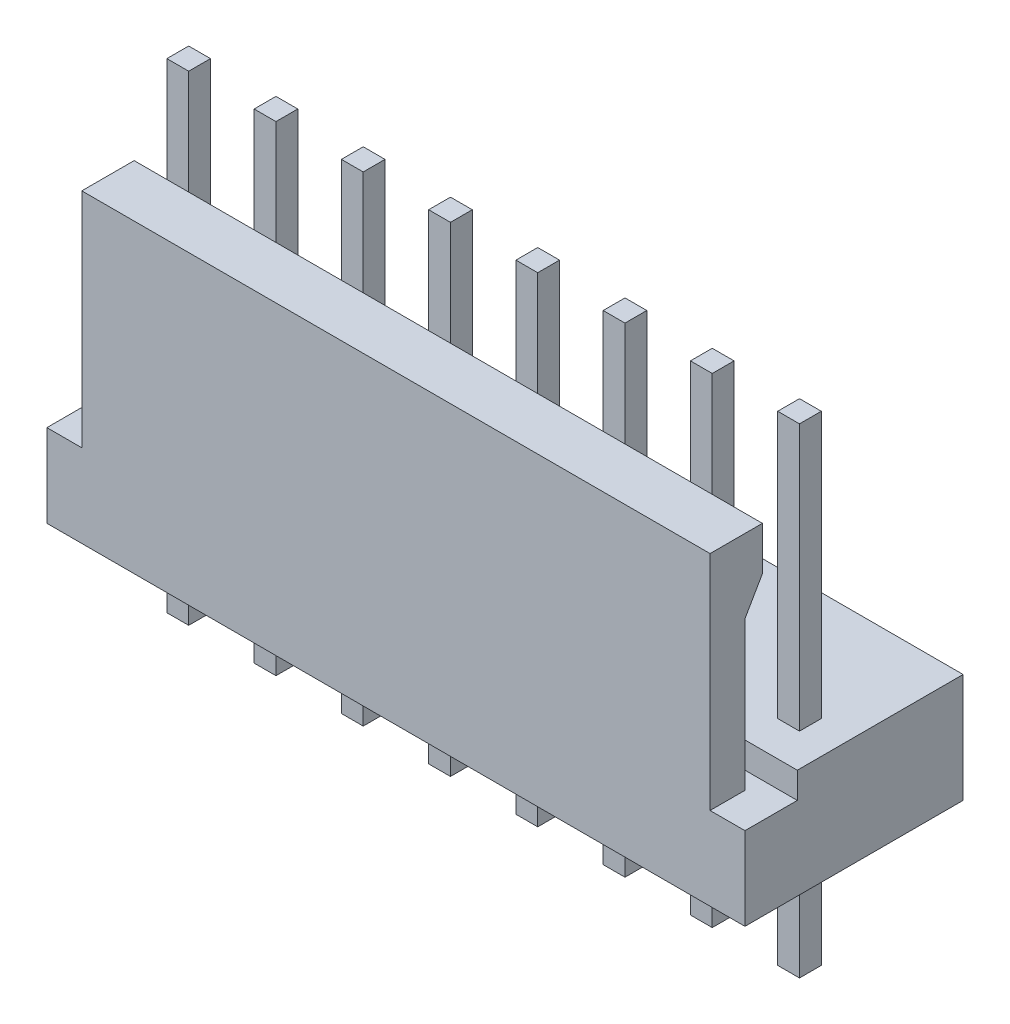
ISO-10303-21;
HEADER;
FILE_DESCRIPTION(('STEP AP214'),'2;1');
FILE_NAME('part.step','',(''),(''),'','','');
FILE_SCHEMA(('AUTOMOTIVE_DESIGN { 1 0 10303 214 1 1 1 1 }'));
ENDSEC;
DATA;
#1=APPLICATION_CONTEXT('core data for automotive mechanical design processes');
#2=APPLICATION_PROTOCOL_DEFINITION('international standard','automotive_design',2000,#1);
#3=PRODUCT_CONTEXT('',#1,'mechanical');
#4=PRODUCT('Part','Part','',(#3));
#5=PRODUCT_RELATED_PRODUCT_CATEGORY('part','',(#4));
#6=PRODUCT_DEFINITION_FORMATION('','',#4);
#7=PRODUCT_DEFINITION_CONTEXT('part definition',#1,'design');
#8=PRODUCT_DEFINITION('design','',#6,#7);
#9=PRODUCT_DEFINITION_SHAPE('','',#8);
#10=(LENGTH_UNIT() NAMED_UNIT(*) SI_UNIT(.MILLI.,.METRE.));
#11=(NAMED_UNIT(*) PLANE_ANGLE_UNIT() SI_UNIT($,.RADIAN.));
#12=(NAMED_UNIT(*) SI_UNIT($,.STERADIAN.) SOLID_ANGLE_UNIT());
#13=UNCERTAINTY_MEASURE_WITH_UNIT(LENGTH_MEASURE(1.E-05),#10,'distance_accuracy_value','');
#14=(GEOMETRIC_REPRESENTATION_CONTEXT(3) GLOBAL_UNCERTAINTY_ASSIGNED_CONTEXT((#13)) GLOBAL_UNIT_ASSIGNED_CONTEXT((#10,
#11,#12)) REPRESENTATION_CONTEXT('',''));
#15=CARTESIAN_POINT('',(0.,0.,0.));
#16=DIRECTION('',(0.,0.,1.));
#17=DIRECTION('',(1.,0.,0.));
#18=AXIS2_PLACEMENT_3D('',#15,#16,#17);
#19=CARTESIAN_POINT('',(18.04924,8.23765582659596,-51.800721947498));
#20=DIRECTION('',(0.,-0.500000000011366,-0.866025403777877));
#21=DIRECTION('',(0.,0.866025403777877,-0.500000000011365));
#22=AXIS2_PLACEMENT_3D('',#19,#20,#21);
#23=PLANE('',#22);
#24=DIRECTION('',(0.,-0.866025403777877,0.500000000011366));
#25=VECTOR('',#24,1.);
#26=CARTESIAN_POINT('',(36.703,8.70405909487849,-52.07));
#27=LINE('',#26,#25);
#28=CARTESIAN_POINT('',(36.703,9.14400000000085,-52.3240000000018));
#29=VERTEX_POINT('',#28);
#30=CARTESIAN_POINT('',(36.703,8.2641181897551,-51.8159999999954));
#31=VERTEX_POINT('',#30);
#32=EDGE_CURVE('E1059',#29,#31,#27,.T.);
#33=ORIENTED_EDGE('',*,*,#32,.T.);
#34=DIRECTION('',(1.,0.,0.));
#35=VECTOR('',#34,1.);
#36=CARTESIAN_POINT('',(27.559,8.26411818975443,-51.816));
#37=LINE('',#36,#35);
#38=CARTESIAN_POINT('',(18.415,8.2641181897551,-51.8159999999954));
#39=VERTEX_POINT('',#38);
#40=EDGE_CURVE('E1025',#39,#31,#37,.T.);
#41=ORIENTED_EDGE('',*,*,#40,.F.);
#42=DIRECTION('',(0.,0.866025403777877,-0.500000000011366));
#43=VECTOR('',#42,1.);
#44=CARTESIAN_POINT('',(18.415,8.70405909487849,-52.07));
#45=LINE('',#44,#43);
#46=CARTESIAN_POINT('',(18.415,9.14400000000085,-52.3240000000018));
#47=VERTEX_POINT('',#46);
#48=EDGE_CURVE('E558',#39,#47,#45,.T.);
#49=ORIENTED_EDGE('',*,*,#48,.T.);
#50=DIRECTION('',(-1.,0.,0.));
#51=VECTOR('',#50,1.);
#52=CARTESIAN_POINT('',(27.559,9.14400000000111,-52.324));
#53=LINE('',#52,#51);
#54=EDGE_CURVE('E1022',#29,#47,#53,.T.);
#55=ORIENTED_EDGE('',*,*,#54,.F.);
#56=EDGE_LOOP('',(#33,#41,#49,#55));
#57=FACE_BOUND('',#56,.T.);
#58=ADVANCED_FACE('F16',(#57),#23,.T.);
#59=CARTESIAN_POINT('',(36.1009438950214,12.7254,-53.975));
#60=DIRECTION('',(0.,0.,-1.));
#61=DIRECTION('',(1.,0.,0.));
#62=AXIS2_PLACEMENT_3D('',#59,#60,#61);
#63=PLANE('',#62);
#64=DIRECTION('',(1.,0.,0.));
#65=VECTOR('',#64,1.);
#66=CARTESIAN_POINT('',(36.449,-1.524,-53.9749999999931));
#67=LINE('',#66,#65);
#68=CARTESIAN_POINT('',(36.1315000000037,-1.524,-53.9749999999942));
#69=VERTEX_POINT('',#68);
#70=CARTESIAN_POINT('',(36.7664999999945,-1.524,-53.9749999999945));
#71=VERTEX_POINT('',#70);
#72=EDGE_CURVE('E1013',#69,#71,#67,.T.);
#73=ORIENTED_EDGE('',*,*,#72,.F.);
#74=DIRECTION('',(0.,-1.,0.));
#75=VECTOR('',#74,1.);
#76=CARTESIAN_POINT('',(36.1315,5.461,-53.9749999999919));
#77=LINE('',#76,#75);
#78=CARTESIAN_POINT('',(36.131500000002,1.524,-53.974999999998));
#79=VERTEX_POINT('',#78);
#80=EDGE_CURVE('E1018',#79,#69,#77,.T.);
#81=ORIENTED_EDGE('',*,*,#80,.F.);
#82=DIRECTION('',(1.,0.,0.));
#83=VECTOR('',#82,1.);
#84=CARTESIAN_POINT('',(36.449,1.524,-53.975));
#85=LINE('',#84,#83);
#86=CARTESIAN_POINT('',(36.766499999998,1.524,-53.974999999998));
#87=VERTEX_POINT('',#86);
#88=EDGE_CURVE('E1058',#79,#87,#85,.T.);
#89=ORIENTED_EDGE('',*,*,#88,.T.);
#90=DIRECTION('',(0.,1.,0.));
#91=VECTOR('',#90,1.);
#92=CARTESIAN_POINT('',(36.7665,5.461,-53.974999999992));
#93=LINE('',#92,#91);
#94=EDGE_CURVE('E1005',#71,#87,#93,.T.);
#95=ORIENTED_EDGE('',*,*,#94,.F.);
#96=EDGE_LOOP('',(#73,#81,#89,#95));
#97=FACE_BOUND('',#96,.T.);
#98=ADVANCED_FACE('F1580',(#97),#63,.T.);
#99=CARTESIAN_POINT('',(33.5609438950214,12.7254,-53.975));
#100=DIRECTION('',(0.,0.,-1.));
#101=DIRECTION('',(1.,0.,0.));
#102=AXIS2_PLACEMENT_3D('',#99,#100,#101);
#103=PLANE('',#102);
#104=DIRECTION('',(1.,0.,0.));
#105=VECTOR('',#104,1.);
#106=CARTESIAN_POINT('',(33.909,-1.524,-53.9749999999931));
#107=LINE('',#106,#105);
#108=CARTESIAN_POINT('',(33.5915000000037,-1.524,-53.9749999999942));
#109=VERTEX_POINT('',#108);
#110=CARTESIAN_POINT('',(34.2264999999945,-1.524,-53.9749999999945));
#111=VERTEX_POINT('',#110);
#112=EDGE_CURVE('E996',#109,#111,#107,.T.);
#113=ORIENTED_EDGE('',*,*,#112,.F.);
#114=DIRECTION('',(0.,-1.,0.));
#115=VECTOR('',#114,1.);
#116=CARTESIAN_POINT('',(33.5915,5.461,-53.9749999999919));
#117=LINE('',#116,#115);
#118=CARTESIAN_POINT('',(33.591500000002,1.524,-53.974999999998));
#119=VERTEX_POINT('',#118);
#120=EDGE_CURVE('E1001',#119,#109,#117,.T.);
#121=ORIENTED_EDGE('',*,*,#120,.F.);
#122=DIRECTION('',(1.,0.,0.));
#123=VECTOR('',#122,1.);
#124=CARTESIAN_POINT('',(33.909,1.524,-53.975));
#125=LINE('',#124,#123);
#126=CARTESIAN_POINT('',(34.226499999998,1.524,-53.974999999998));
#127=VERTEX_POINT('',#126);
#128=EDGE_CURVE('E1056',#119,#127,#125,.T.);
#129=ORIENTED_EDGE('',*,*,#128,.T.);
#130=DIRECTION('',(0.,1.,0.));
#131=VECTOR('',#130,1.);
#132=CARTESIAN_POINT('',(34.2265,5.461,-53.974999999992));
#133=LINE('',#132,#131);
#134=EDGE_CURVE('E988',#111,#127,#133,.T.);
#135=ORIENTED_EDGE('',*,*,#134,.F.);
#136=EDGE_LOOP('',(#113,#121,#129,#135));
#137=FACE_BOUND('',#136,.T.);
#138=ADVANCED_FACE('F1576',(#137),#103,.T.);
#139=CARTESIAN_POINT('',(31.0209438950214,12.7254,-53.975));
#140=DIRECTION('',(0.,0.,-1.));
#141=DIRECTION('',(1.,0.,0.));
#142=AXIS2_PLACEMENT_3D('',#139,#140,#141);
#143=PLANE('',#142);
#144=DIRECTION('',(1.,0.,0.));
#145=VECTOR('',#144,1.);
#146=CARTESIAN_POINT('',(31.369,-1.524,-53.9749999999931));
#147=LINE('',#146,#145);
#148=CARTESIAN_POINT('',(31.0515000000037,-1.524,-53.9749999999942));
#149=VERTEX_POINT('',#148);
#150=CARTESIAN_POINT('',(31.6864999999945,-1.524,-53.9749999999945));
#151=VERTEX_POINT('',#150);
#152=EDGE_CURVE('E979',#149,#151,#147,.T.);
#153=ORIENTED_EDGE('',*,*,#152,.F.);
#154=DIRECTION('',(0.,-1.,0.));
#155=VECTOR('',#154,1.);
#156=CARTESIAN_POINT('',(31.0515,5.461,-53.9749999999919));
#157=LINE('',#156,#155);
#158=CARTESIAN_POINT('',(31.051500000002,1.524,-53.974999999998));
#159=VERTEX_POINT('',#158);
#160=EDGE_CURVE('E984',#159,#149,#157,.T.);
#161=ORIENTED_EDGE('',*,*,#160,.F.);
#162=DIRECTION('',(1.,0.,0.));
#163=VECTOR('',#162,1.);
#164=CARTESIAN_POINT('',(31.369,1.524,-53.975));
#165=LINE('',#164,#163);
#166=CARTESIAN_POINT('',(31.686499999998,1.524,-53.974999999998));
#167=VERTEX_POINT('',#166);
#168=EDGE_CURVE('E1054',#159,#167,#165,.T.);
#169=ORIENTED_EDGE('',*,*,#168,.T.);
#170=DIRECTION('',(0.,1.,0.));
#171=VECTOR('',#170,1.);
#172=CARTESIAN_POINT('',(31.6865,5.461,-53.974999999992));
#173=LINE('',#172,#171);
#174=EDGE_CURVE('E971',#151,#167,#173,.T.);
#175=ORIENTED_EDGE('',*,*,#174,.F.);
#176=EDGE_LOOP('',(#153,#161,#169,#175));
#177=FACE_BOUND('',#176,.T.);
#178=ADVANCED_FACE('F1572',(#177),#143,.T.);
#179=CARTESIAN_POINT('',(28.4809438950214,12.7254,-53.975));
#180=DIRECTION('',(0.,0.,-1.));
#181=DIRECTION('',(1.,0.,0.));
#182=AXIS2_PLACEMENT_3D('',#179,#180,#181);
#183=PLANE('',#182);
#184=DIRECTION('',(1.,0.,0.));
#185=VECTOR('',#184,1.);
#186=CARTESIAN_POINT('',(28.829,-1.524,-53.9749999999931));
#187=LINE('',#186,#185);
#188=CARTESIAN_POINT('',(28.5115000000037,-1.524,-53.9749999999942));
#189=VERTEX_POINT('',#188);
#190=CARTESIAN_POINT('',(29.1464999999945,-1.524,-53.9749999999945));
#191=VERTEX_POINT('',#190);
#192=EDGE_CURVE('E962',#189,#191,#187,.T.);
#193=ORIENTED_EDGE('',*,*,#192,.F.);
#194=DIRECTION('',(0.,-1.,0.));
#195=VECTOR('',#194,1.);
#196=CARTESIAN_POINT('',(28.5115,5.461,-53.9749999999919));
#197=LINE('',#196,#195);
#198=CARTESIAN_POINT('',(28.511500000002,1.524,-53.974999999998));
#199=VERTEX_POINT('',#198);
#200=EDGE_CURVE('E967',#199,#189,#197,.T.);
#201=ORIENTED_EDGE('',*,*,#200,.F.);
#202=DIRECTION('',(1.,0.,0.));
#203=VECTOR('',#202,1.);
#204=CARTESIAN_POINT('',(28.829,1.524,-53.975));
#205=LINE('',#204,#203);
#206=CARTESIAN_POINT('',(29.146499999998,1.524,-53.974999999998));
#207=VERTEX_POINT('',#206);
#208=EDGE_CURVE('E1052',#199,#207,#205,.T.);
#209=ORIENTED_EDGE('',*,*,#208,.T.);
#210=DIRECTION('',(0.,1.,0.));
#211=VECTOR('',#210,1.);
#212=CARTESIAN_POINT('',(29.1465,5.461,-53.974999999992));
#213=LINE('',#212,#211);
#214=EDGE_CURVE('E954',#191,#207,#213,.T.);
#215=ORIENTED_EDGE('',*,*,#214,.F.);
#216=EDGE_LOOP('',(#193,#201,#209,#215));
#217=FACE_BOUND('',#216,.T.);
#218=ADVANCED_FACE('F1568',(#217),#183,.T.);
#219=CARTESIAN_POINT('',(25.9409438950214,12.7254,-53.975));
#220=DIRECTION('',(0.,0.,-1.));
#221=DIRECTION('',(1.,0.,0.));
#222=AXIS2_PLACEMENT_3D('',#219,#220,#221);
#223=PLANE('',#222);
#224=DIRECTION('',(1.,0.,0.));
#225=VECTOR('',#224,1.);
#226=CARTESIAN_POINT('',(26.289,-1.524,-53.9749999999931));
#227=LINE('',#226,#225);
#228=CARTESIAN_POINT('',(25.9715000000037,-1.524,-53.9749999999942));
#229=VERTEX_POINT('',#228);
#230=CARTESIAN_POINT('',(26.6064999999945,-1.524,-53.9749999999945));
#231=VERTEX_POINT('',#230);
#232=EDGE_CURVE('E945',#229,#231,#227,.T.);
#233=ORIENTED_EDGE('',*,*,#232,.F.);
#234=DIRECTION('',(0.,-1.,0.));
#235=VECTOR('',#234,1.);
#236=CARTESIAN_POINT('',(25.9715,5.461,-53.9749999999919));
#237=LINE('',#236,#235);
#238=CARTESIAN_POINT('',(25.971500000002,1.524,-53.974999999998));
#239=VERTEX_POINT('',#238);
#240=EDGE_CURVE('E950',#239,#229,#237,.T.);
#241=ORIENTED_EDGE('',*,*,#240,.F.);
#242=DIRECTION('',(1.,0.,0.));
#243=VECTOR('',#242,1.);
#244=CARTESIAN_POINT('',(26.289,1.524,-53.975));
#245=LINE('',#244,#243);
#246=CARTESIAN_POINT('',(26.606499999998,1.524,-53.974999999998));
#247=VERTEX_POINT('',#246);
#248=EDGE_CURVE('E1050',#239,#247,#245,.T.);
#249=ORIENTED_EDGE('',*,*,#248,.T.);
#250=DIRECTION('',(0.,1.,0.));
#251=VECTOR('',#250,1.);
#252=CARTESIAN_POINT('',(26.6065,5.461,-53.974999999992));
#253=LINE('',#252,#251);
#254=EDGE_CURVE('E937',#231,#247,#253,.T.);
#255=ORIENTED_EDGE('',*,*,#254,.F.);
#256=EDGE_LOOP('',(#233,#241,#249,#255));
#257=FACE_BOUND('',#256,.T.);
#258=ADVANCED_FACE('F1564',(#257),#223,.T.);
#259=CARTESIAN_POINT('',(23.4009438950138,12.7254,-53.975));
#260=DIRECTION('',(0.,0.,-1.));
#261=DIRECTION('',(1.,0.,0.));
#262=AXIS2_PLACEMENT_3D('',#259,#260,#261);
#263=PLANE('',#262);
#264=DIRECTION('',(1.,0.,0.));
#265=VECTOR('',#264,1.);
#266=CARTESIAN_POINT('',(23.749,-1.524,-53.9749999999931));
#267=LINE('',#266,#265);
#268=CARTESIAN_POINT('',(23.4315000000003,-1.524,-53.9749999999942));
#269=VERTEX_POINT('',#268);
#270=CARTESIAN_POINT('',(24.0664999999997,-1.524,-53.9749999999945));
#271=VERTEX_POINT('',#270);
#272=EDGE_CURVE('E928',#269,#271,#267,.T.);
#273=ORIENTED_EDGE('',*,*,#272,.F.);
#274=DIRECTION('',(0.,-1.,0.));
#275=VECTOR('',#274,1.);
#276=CARTESIAN_POINT('',(23.4315,5.461,-53.9749999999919));
#277=LINE('',#276,#275);
#278=CARTESIAN_POINT('',(23.4315000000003,1.524,-53.974999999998));
#279=VERTEX_POINT('',#278);
#280=EDGE_CURVE('E933',#279,#269,#277,.T.);
#281=ORIENTED_EDGE('',*,*,#280,.F.);
#282=DIRECTION('',(1.,0.,0.));
#283=VECTOR('',#282,1.);
#284=CARTESIAN_POINT('',(23.749,1.524,-53.975));
#285=LINE('',#284,#283);
#286=CARTESIAN_POINT('',(24.0664999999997,1.524,-53.974999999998));
#287=VERTEX_POINT('',#286);
#288=EDGE_CURVE('E1048',#279,#287,#285,.T.);
#289=ORIENTED_EDGE('',*,*,#288,.T.);
#290=DIRECTION('',(0.,1.,0.));
#291=VECTOR('',#290,1.);
#292=CARTESIAN_POINT('',(24.0665,5.461,-53.974999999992));
#293=LINE('',#292,#291);
#294=EDGE_CURVE('E920',#271,#287,#293,.T.);
#295=ORIENTED_EDGE('',*,*,#294,.F.);
#296=EDGE_LOOP('',(#273,#281,#289,#295));
#297=FACE_BOUND('',#296,.T.);
#298=ADVANCED_FACE('F1560',(#297),#263,.T.);
#299=CARTESIAN_POINT('',(20.8609438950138,12.7254,-53.975));
#300=DIRECTION('',(0.,0.,-1.));
#301=DIRECTION('',(1.,0.,0.));
#302=AXIS2_PLACEMENT_3D('',#299,#300,#301);
#303=PLANE('',#302);
#304=DIRECTION('',(1.,0.,0.));
#305=VECTOR('',#304,1.);
#306=CARTESIAN_POINT('',(21.209,-1.524,-53.9749999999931));
#307=LINE('',#306,#305);
#308=CARTESIAN_POINT('',(20.8915000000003,-1.524,-53.9749999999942));
#309=VERTEX_POINT('',#308);
#310=CARTESIAN_POINT('',(21.5264999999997,-1.524,-53.9749999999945));
#311=VERTEX_POINT('',#310);
#312=EDGE_CURVE('E911',#309,#311,#307,.T.);
#313=ORIENTED_EDGE('',*,*,#312,.F.);
#314=DIRECTION('',(0.,-1.,0.));
#315=VECTOR('',#314,1.);
#316=CARTESIAN_POINT('',(20.8915,5.461,-53.9749999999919));
#317=LINE('',#316,#315);
#318=CARTESIAN_POINT('',(20.8915000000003,1.524,-53.974999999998));
#319=VERTEX_POINT('',#318);
#320=EDGE_CURVE('E916',#319,#309,#317,.T.);
#321=ORIENTED_EDGE('',*,*,#320,.F.);
#322=DIRECTION('',(1.,0.,0.));
#323=VECTOR('',#322,1.);
#324=CARTESIAN_POINT('',(21.209,1.524,-53.975));
#325=LINE('',#324,#323);
#326=CARTESIAN_POINT('',(21.5264999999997,1.524,-53.974999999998));
#327=VERTEX_POINT('',#326);
#328=EDGE_CURVE('E1046',#319,#327,#325,.T.);
#329=ORIENTED_EDGE('',*,*,#328,.T.);
#330=DIRECTION('',(0.,1.,0.));
#331=VECTOR('',#330,1.);
#332=CARTESIAN_POINT('',(21.5265,5.461,-53.974999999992));
#333=LINE('',#332,#331);
#334=EDGE_CURVE('E903',#311,#327,#333,.T.);
#335=ORIENTED_EDGE('',*,*,#334,.F.);
#336=EDGE_LOOP('',(#313,#321,#329,#335));
#337=FACE_BOUND('',#336,.T.);
#338=ADVANCED_FACE('F1556',(#337),#303,.T.);
#339=CARTESIAN_POINT('',(18.3209438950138,12.7254,-53.975));
#340=DIRECTION('',(0.,0.,-1.));
#341=DIRECTION('',(1.,0.,0.));
#342=AXIS2_PLACEMENT_3D('',#339,#340,#341);
#343=PLANE('',#342);
#344=DIRECTION('',(1.,0.,0.));
#345=VECTOR('',#344,1.);
#346=CARTESIAN_POINT('',(18.669,-1.524,-53.9749999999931));
#347=LINE('',#346,#345);
#348=CARTESIAN_POINT('',(18.3515000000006,-1.524,-53.9749999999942));
#349=VERTEX_POINT('',#348);
#350=CARTESIAN_POINT('',(18.9864999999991,-1.524,-53.9749999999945));
#351=VERTEX_POINT('',#350);
#352=EDGE_CURVE('E894',#349,#351,#347,.T.);
#353=ORIENTED_EDGE('',*,*,#352,.F.);
#354=DIRECTION('',(0.,-1.,0.));
#355=VECTOR('',#354,1.);
#356=CARTESIAN_POINT('',(18.3515,5.461,-53.9749999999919));
#357=LINE('',#356,#355);
#358=CARTESIAN_POINT('',(18.3515000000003,1.524,-53.974999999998));
#359=VERTEX_POINT('',#358);
#360=EDGE_CURVE('E899',#359,#349,#357,.T.);
#361=ORIENTED_EDGE('',*,*,#360,.F.);
#362=DIRECTION('',(1.,0.,0.));
#363=VECTOR('',#362,1.);
#364=CARTESIAN_POINT('',(18.669,1.524,-53.975));
#365=LINE('',#364,#363);
#366=CARTESIAN_POINT('',(18.9864999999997,1.524,-53.974999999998));
#367=VERTEX_POINT('',#366);
#368=EDGE_CURVE('E1044',#359,#367,#365,.T.);
#369=ORIENTED_EDGE('',*,*,#368,.T.);
#370=DIRECTION('',(0.,1.,0.));
#371=VECTOR('',#370,1.);
#372=CARTESIAN_POINT('',(18.9865,5.461,-53.974999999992));
#373=LINE('',#372,#371);
#374=EDGE_CURVE('E886',#351,#367,#373,.T.);
#375=ORIENTED_EDGE('',*,*,#374,.F.);
#376=EDGE_LOOP('',(#353,#361,#369,#375));
#377=FACE_BOUND('',#376,.T.);
#378=ADVANCED_FACE('F1552',(#377),#343,.T.);
#379=CARTESIAN_POINT('',(36.7970561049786,12.7254,-53.34));
#380=DIRECTION('',(0.,0.,1.));
#381=DIRECTION('',(-1.,0.,0.));
#382=AXIS2_PLACEMENT_3D('',#379,#380,#381);
#383=PLANE('',#382);
#384=DIRECTION('',(-1.,0.,0.));
#385=VECTOR('',#384,1.);
#386=CARTESIAN_POINT('',(36.449,12.446,-53.3400000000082));
#387=LINE('',#386,#385);
#388=CARTESIAN_POINT('',(36.7664999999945,12.446,-53.3400000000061));
#389=VERTEX_POINT('',#388);
#390=CARTESIAN_POINT('',(36.1315000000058,12.446,-53.3400000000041));
#391=VERTEX_POINT('',#390);
#392=EDGE_CURVE('E869',#389,#391,#387,.T.);
#393=ORIENTED_EDGE('',*,*,#392,.T.);
#394=DIRECTION('',(0.,1.,0.));
#395=VECTOR('',#394,1.);
#396=CARTESIAN_POINT('',(36.1315,5.461,-53.340000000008));
#397=LINE('',#396,#395);
#398=CARTESIAN_POINT('',(36.131500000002,4.699,-53.340000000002));
#399=VERTEX_POINT('',#398);
#400=EDGE_CURVE('E872',#399,#391,#397,.T.);
#401=ORIENTED_EDGE('',*,*,#400,.F.);
#402=DIRECTION('',(1.,0.,0.));
#403=VECTOR('',#402,1.);
#404=CARTESIAN_POINT('',(36.449,4.699,-53.34));
#405=LINE('',#404,#403);
#406=CARTESIAN_POINT('',(36.766499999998,4.699,-53.340000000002));
#407=VERTEX_POINT('',#406);
#408=EDGE_CURVE('E1042',#399,#407,#405,.T.);
#409=ORIENTED_EDGE('',*,*,#408,.T.);
#410=DIRECTION('',(0.,-1.,0.));
#411=VECTOR('',#410,1.);
#412=CARTESIAN_POINT('',(36.7665,5.461,-53.3400000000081));
#413=LINE('',#412,#411);
#414=EDGE_CURVE('E858',#389,#407,#413,.T.);
#415=ORIENTED_EDGE('',*,*,#414,.F.);
#416=EDGE_LOOP('',(#393,#401,#409,#415));
#417=FACE_BOUND('',#416,.T.);
#418=ADVANCED_FACE('F1548',(#417),#383,.T.);
#419=CARTESIAN_POINT('',(34.2570561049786,12.7254,-53.34));
#420=DIRECTION('',(0.,0.,1.));
#421=DIRECTION('',(-1.,0.,0.));
#422=AXIS2_PLACEMENT_3D('',#419,#420,#421);
#423=PLANE('',#422);
#424=DIRECTION('',(-1.,0.,0.));
#425=VECTOR('',#424,1.);
#426=CARTESIAN_POINT('',(33.909,12.446,-53.3400000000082));
#427=LINE('',#426,#425);
#428=CARTESIAN_POINT('',(34.2264999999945,12.446,-53.3400000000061));
#429=VERTEX_POINT('',#428);
#430=CARTESIAN_POINT('',(33.5915000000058,12.446,-53.3400000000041));
#431=VERTEX_POINT('',#430);
#432=EDGE_CURVE('E851',#429,#431,#427,.T.);
#433=ORIENTED_EDGE('',*,*,#432,.T.);
#434=DIRECTION('',(0.,1.,0.));
#435=VECTOR('',#434,1.);
#436=CARTESIAN_POINT('',(33.5915,5.461,-53.340000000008));
#437=LINE('',#436,#435);
#438=CARTESIAN_POINT('',(33.591500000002,4.699,-53.340000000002));
#439=VERTEX_POINT('',#438);
#440=EDGE_CURVE('E854',#439,#431,#437,.T.);
#441=ORIENTED_EDGE('',*,*,#440,.F.);
#442=DIRECTION('',(1.,0.,0.));
#443=VECTOR('',#442,1.);
#444=CARTESIAN_POINT('',(33.909,4.699,-53.34));
#445=LINE('',#444,#443);
#446=CARTESIAN_POINT('',(34.226499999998,4.699,-53.340000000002));
#447=VERTEX_POINT('',#446);
#448=EDGE_CURVE('E1040',#439,#447,#445,.T.);
#449=ORIENTED_EDGE('',*,*,#448,.T.);
#450=DIRECTION('',(0.,-1.,0.));
#451=VECTOR('',#450,1.);
#452=CARTESIAN_POINT('',(34.2265,5.461,-53.3400000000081));
#453=LINE('',#452,#451);
#454=EDGE_CURVE('E840',#429,#447,#453,.T.);
#455=ORIENTED_EDGE('',*,*,#454,.F.);
#456=EDGE_LOOP('',(#433,#441,#449,#455));
#457=FACE_BOUND('',#456,.T.);
#458=ADVANCED_FACE('F1544',(#457),#423,.T.);
#459=CARTESIAN_POINT('',(31.7170561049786,12.7254,-53.34));
#460=DIRECTION('',(0.,0.,1.));
#461=DIRECTION('',(-1.,0.,0.));
#462=AXIS2_PLACEMENT_3D('',#459,#460,#461);
#463=PLANE('',#462);
#464=DIRECTION('',(-1.,0.,0.));
#465=VECTOR('',#464,1.);
#466=CARTESIAN_POINT('',(31.369,12.446,-53.3400000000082));
#467=LINE('',#466,#465);
#468=CARTESIAN_POINT('',(31.6864999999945,12.446,-53.3400000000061));
#469=VERTEX_POINT('',#468);
#470=CARTESIAN_POINT('',(31.0515000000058,12.446,-53.3400000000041));
#471=VERTEX_POINT('',#470);
#472=EDGE_CURVE('E833',#469,#471,#467,.T.);
#473=ORIENTED_EDGE('',*,*,#472,.T.);
#474=DIRECTION('',(0.,1.,0.));
#475=VECTOR('',#474,1.);
#476=CARTESIAN_POINT('',(31.0515,5.461,-53.340000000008));
#477=LINE('',#476,#475);
#478=CARTESIAN_POINT('',(31.051500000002,4.699,-53.340000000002));
#479=VERTEX_POINT('',#478);
#480=EDGE_CURVE('E836',#479,#471,#477,.T.);
#481=ORIENTED_EDGE('',*,*,#480,.F.);
#482=DIRECTION('',(1.,0.,0.));
#483=VECTOR('',#482,1.);
#484=CARTESIAN_POINT('',(31.369,4.699,-53.34));
#485=LINE('',#484,#483);
#486=CARTESIAN_POINT('',(31.686499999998,4.699,-53.340000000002));
#487=VERTEX_POINT('',#486);
#488=EDGE_CURVE('E1038',#479,#487,#485,.T.);
#489=ORIENTED_EDGE('',*,*,#488,.T.);
#490=DIRECTION('',(0.,-1.,0.));
#491=VECTOR('',#490,1.);
#492=CARTESIAN_POINT('',(31.6865,5.461,-53.3400000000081));
#493=LINE('',#492,#491);
#494=EDGE_CURVE('E822',#469,#487,#493,.T.);
#495=ORIENTED_EDGE('',*,*,#494,.F.);
#496=EDGE_LOOP('',(#473,#481,#489,#495));
#497=FACE_BOUND('',#496,.T.);
#498=ADVANCED_FACE('F1540',(#497),#463,.T.);
#499=CARTESIAN_POINT('',(29.1770561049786,12.7254,-53.34));
#500=DIRECTION('',(0.,0.,1.));
#501=DIRECTION('',(-1.,0.,0.));
#502=AXIS2_PLACEMENT_3D('',#499,#500,#501);
#503=PLANE('',#502);
#504=DIRECTION('',(-1.,0.,0.));
#505=VECTOR('',#504,1.);
#506=CARTESIAN_POINT('',(28.829,12.446,-53.3400000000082));
#507=LINE('',#506,#505);
#508=CARTESIAN_POINT('',(29.1464999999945,12.446,-53.3400000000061));
#509=VERTEX_POINT('',#508);
#510=CARTESIAN_POINT('',(28.5115000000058,12.446,-53.3400000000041));
#511=VERTEX_POINT('',#510);
#512=EDGE_CURVE('E815',#509,#511,#507,.T.);
#513=ORIENTED_EDGE('',*,*,#512,.T.);
#514=DIRECTION('',(0.,1.,0.));
#515=VECTOR('',#514,1.);
#516=CARTESIAN_POINT('',(28.5115,5.461,-53.340000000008));
#517=LINE('',#516,#515);
#518=CARTESIAN_POINT('',(28.511500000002,4.699,-53.340000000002));
#519=VERTEX_POINT('',#518);
#520=EDGE_CURVE('E818',#519,#511,#517,.T.);
#521=ORIENTED_EDGE('',*,*,#520,.F.);
#522=DIRECTION('',(1.,0.,0.));
#523=VECTOR('',#522,1.);
#524=CARTESIAN_POINT('',(28.829,4.699,-53.34));
#525=LINE('',#524,#523);
#526=CARTESIAN_POINT('',(29.146499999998,4.699,-53.340000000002));
#527=VERTEX_POINT('',#526);
#528=EDGE_CURVE('E1036',#519,#527,#525,.T.);
#529=ORIENTED_EDGE('',*,*,#528,.T.);
#530=DIRECTION('',(0.,-1.,0.));
#531=VECTOR('',#530,1.);
#532=CARTESIAN_POINT('',(29.1465,5.461,-53.3400000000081));
#533=LINE('',#532,#531);
#534=EDGE_CURVE('E804',#509,#527,#533,.T.);
#535=ORIENTED_EDGE('',*,*,#534,.F.);
#536=EDGE_LOOP('',(#513,#521,#529,#535));
#537=FACE_BOUND('',#536,.T.);
#538=ADVANCED_FACE('F1536',(#537),#503,.T.);
#539=CARTESIAN_POINT('',(26.6370561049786,12.7254,-53.34));
#540=DIRECTION('',(0.,0.,1.));
#541=DIRECTION('',(-1.,0.,0.));
#542=AXIS2_PLACEMENT_3D('',#539,#540,#541);
#543=PLANE('',#542);
#544=DIRECTION('',(-1.,0.,0.));
#545=VECTOR('',#544,1.);
#546=CARTESIAN_POINT('',(26.289,12.446,-53.3400000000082));
#547=LINE('',#546,#545);
#548=CARTESIAN_POINT('',(26.6064999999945,12.446,-53.3400000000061));
#549=VERTEX_POINT('',#548);
#550=CARTESIAN_POINT('',(25.9715000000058,12.446,-53.3400000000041));
#551=VERTEX_POINT('',#550);
#552=EDGE_CURVE('E797',#549,#551,#547,.T.);
#553=ORIENTED_EDGE('',*,*,#552,.T.);
#554=DIRECTION('',(0.,1.,0.));
#555=VECTOR('',#554,1.);
#556=CARTESIAN_POINT('',(25.9715,5.461,-53.340000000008));
#557=LINE('',#556,#555);
#558=CARTESIAN_POINT('',(25.971500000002,4.699,-53.340000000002));
#559=VERTEX_POINT('',#558);
#560=EDGE_CURVE('E800',#559,#551,#557,.T.);
#561=ORIENTED_EDGE('',*,*,#560,.F.);
#562=DIRECTION('',(1.,0.,0.));
#563=VECTOR('',#562,1.);
#564=CARTESIAN_POINT('',(26.289,4.699,-53.34));
#565=LINE('',#564,#563);
#566=CARTESIAN_POINT('',(26.606499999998,4.699,-53.340000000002));
#567=VERTEX_POINT('',#566);
#568=EDGE_CURVE('E1034',#559,#567,#565,.T.);
#569=ORIENTED_EDGE('',*,*,#568,.T.);
#570=DIRECTION('',(0.,-1.,0.));
#571=VECTOR('',#570,1.);
#572=CARTESIAN_POINT('',(26.6065,5.461,-53.3400000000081));
#573=LINE('',#572,#571);
#574=EDGE_CURVE('E786',#549,#567,#573,.T.);
#575=ORIENTED_EDGE('',*,*,#574,.F.);
#576=EDGE_LOOP('',(#553,#561,#569,#575));
#577=FACE_BOUND('',#576,.T.);
#578=ADVANCED_FACE('F1532',(#577),#543,.T.);
#579=CARTESIAN_POINT('',(24.0970561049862,12.7254,-53.34));
#580=DIRECTION('',(0.,0.,1.));
#581=DIRECTION('',(-1.,0.,0.));
#582=AXIS2_PLACEMENT_3D('',#579,#580,#581);
#583=PLANE('',#582);
#584=DIRECTION('',(-1.,0.,0.));
#585=VECTOR('',#584,1.);
#586=CARTESIAN_POINT('',(23.749,12.446,-53.3400000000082));
#587=LINE('',#586,#585);
#588=CARTESIAN_POINT('',(24.0664999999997,12.446,-53.3400000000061));
#589=VERTEX_POINT('',#588);
#590=CARTESIAN_POINT('',(23.4315000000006,12.446,-53.3400000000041));
#591=VERTEX_POINT('',#590);
#592=EDGE_CURVE('E779',#589,#591,#587,.T.);
#593=ORIENTED_EDGE('',*,*,#592,.T.);
#594=DIRECTION('',(0.,1.,0.));
#595=VECTOR('',#594,1.);
#596=CARTESIAN_POINT('',(23.4315,5.461,-53.340000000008));
#597=LINE('',#596,#595);
#598=CARTESIAN_POINT('',(23.4315000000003,4.699,-53.340000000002));
#599=VERTEX_POINT('',#598);
#600=EDGE_CURVE('E782',#599,#591,#597,.T.);
#601=ORIENTED_EDGE('',*,*,#600,.F.);
#602=DIRECTION('',(1.,0.,0.));
#603=VECTOR('',#602,1.);
#604=CARTESIAN_POINT('',(23.749,4.699,-53.34));
#605=LINE('',#604,#603);
#606=CARTESIAN_POINT('',(24.0664999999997,4.699,-53.340000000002));
#607=VERTEX_POINT('',#606);
#608=EDGE_CURVE('E1032',#599,#607,#605,.T.);
#609=ORIENTED_EDGE('',*,*,#608,.T.);
#610=DIRECTION('',(0.,-1.,0.));
#611=VECTOR('',#610,1.);
#612=CARTESIAN_POINT('',(24.0665,5.461,-53.3400000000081));
#613=LINE('',#612,#611);
#614=EDGE_CURVE('E768',#589,#607,#613,.T.);
#615=ORIENTED_EDGE('',*,*,#614,.F.);
#616=EDGE_LOOP('',(#593,#601,#609,#615));
#617=FACE_BOUND('',#616,.T.);
#618=ADVANCED_FACE('F1528',(#617),#583,.T.);
#619=CARTESIAN_POINT('',(21.5570561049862,12.7254,-53.34));
#620=DIRECTION('',(0.,0.,1.));
#621=DIRECTION('',(-1.,0.,0.));
#622=AXIS2_PLACEMENT_3D('',#619,#620,#621);
#623=PLANE('',#622);
#624=DIRECTION('',(-1.,0.,0.));
#625=VECTOR('',#624,1.);
#626=CARTESIAN_POINT('',(21.209,12.446,-53.3400000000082));
#627=LINE('',#626,#625);
#628=CARTESIAN_POINT('',(21.5264999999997,12.446,-53.3400000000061));
#629=VERTEX_POINT('',#628);
#630=CARTESIAN_POINT('',(20.8915000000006,12.446,-53.3400000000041));
#631=VERTEX_POINT('',#630);
#632=EDGE_CURVE('E761',#629,#631,#627,.T.);
#633=ORIENTED_EDGE('',*,*,#632,.T.);
#634=DIRECTION('',(0.,1.,0.));
#635=VECTOR('',#634,1.);
#636=CARTESIAN_POINT('',(20.8915,5.461,-53.340000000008));
#637=LINE('',#636,#635);
#638=CARTESIAN_POINT('',(20.8915000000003,4.699,-53.340000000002));
#639=VERTEX_POINT('',#638);
#640=EDGE_CURVE('E764',#639,#631,#637,.T.);
#641=ORIENTED_EDGE('',*,*,#640,.F.);
#642=DIRECTION('',(1.,0.,0.));
#643=VECTOR('',#642,1.);
#644=CARTESIAN_POINT('',(21.209,4.699,-53.34));
#645=LINE('',#644,#643);
#646=CARTESIAN_POINT('',(21.5264999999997,4.699,-53.340000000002));
#647=VERTEX_POINT('',#646);
#648=EDGE_CURVE('E1030',#639,#647,#645,.T.);
#649=ORIENTED_EDGE('',*,*,#648,.T.);
#650=DIRECTION('',(0.,-1.,0.));
#651=VECTOR('',#650,1.);
#652=CARTESIAN_POINT('',(21.5265,5.461,-53.3400000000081));
#653=LINE('',#652,#651);
#654=EDGE_CURVE('E750',#629,#647,#653,.T.);
#655=ORIENTED_EDGE('',*,*,#654,.F.);
#656=EDGE_LOOP('',(#633,#641,#649,#655));
#657=FACE_BOUND('',#656,.T.);
#658=ADVANCED_FACE('F1524',(#657),#623,.T.);
#659=CARTESIAN_POINT('',(19.0170561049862,12.7254,-53.34));
#660=DIRECTION('',(0.,0.,1.));
#661=DIRECTION('',(-1.,0.,0.));
#662=AXIS2_PLACEMENT_3D('',#659,#660,#661);
#663=PLANE('',#662);
#664=DIRECTION('',(-1.,0.,0.));
#665=VECTOR('',#664,1.);
#666=CARTESIAN_POINT('',(18.669,12.446,-53.3400000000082));
#667=LINE('',#666,#665);
#668=CARTESIAN_POINT('',(18.9864999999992,12.446,-53.3400000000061));
#669=VERTEX_POINT('',#668);
#670=CARTESIAN_POINT('',(18.3515000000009,12.446,-53.3400000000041));
#671=VERTEX_POINT('',#670);
#672=EDGE_CURVE('E743',#669,#671,#667,.T.);
#673=ORIENTED_EDGE('',*,*,#672,.T.);
#674=DIRECTION('',(0.,1.,0.));
#675=VECTOR('',#674,1.);
#676=CARTESIAN_POINT('',(18.3515,5.461,-53.340000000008));
#677=LINE('',#676,#675);
#678=CARTESIAN_POINT('',(18.3515000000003,4.699,-53.340000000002));
#679=VERTEX_POINT('',#678);
#680=EDGE_CURVE('E746',#679,#671,#677,.T.);
#681=ORIENTED_EDGE('',*,*,#680,.F.);
#682=DIRECTION('',(1.,0.,0.));
#683=VECTOR('',#682,1.);
#684=CARTESIAN_POINT('',(18.669,4.699,-53.34));
#685=LINE('',#684,#683);
#686=CARTESIAN_POINT('',(18.9864999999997,4.699,-53.340000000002));
#687=VERTEX_POINT('',#686);
#688=EDGE_CURVE('E1028',#679,#687,#685,.T.);
#689=ORIENTED_EDGE('',*,*,#688,.T.);
#690=DIRECTION('',(0.,-1.,0.));
#691=VECTOR('',#690,1.);
#692=CARTESIAN_POINT('',(18.9865,5.461,-53.3400000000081));
#693=LINE('',#692,#691);
#694=EDGE_CURVE('E732',#669,#687,#693,.T.);
#695=ORIENTED_EDGE('',*,*,#694,.F.);
#696=EDGE_LOOP('',(#673,#681,#689,#695));
#697=FACE_BOUND('',#696,.T.);
#698=ADVANCED_FACE('F1521',(#697),#663,.T.);
#699=CARTESIAN_POINT('',(18.04924,3.8504576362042,-51.816));
#700=DIRECTION('',(0.,0.,-1.));
#701=DIRECTION('',(0.,1.,0.));
#702=AXIS2_PLACEMENT_3D('',#699,#700,#701);
#703=PLANE('',#702);
#704=DIRECTION('',(0.,1.,0.));
#705=VECTOR('',#704,1.);
#706=CARTESIAN_POINT('',(36.703,7.1755,-51.8159999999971));
#707=LINE('',#706,#705);
#708=CARTESIAN_POINT('',(36.703,3.93699999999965,-51.8159999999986));
#709=VERTEX_POINT('',#708);
#710=EDGE_CURVE('E721',#709,#31,#707,.T.);
#711=ORIENTED_EDGE('',*,*,#710,.F.);
#712=DIRECTION('',(1.,0.,0.));
#713=VECTOR('',#712,1.);
#714=CARTESIAN_POINT('',(27.559,3.937,-51.8159999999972));
#715=LINE('',#714,#713);
#716=CARTESIAN_POINT('',(18.415,3.93699999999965,-51.8159999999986));
#717=VERTEX_POINT('',#716);
#718=EDGE_CURVE('E884',#717,#709,#715,.T.);
#719=ORIENTED_EDGE('',*,*,#718,.F.);
#720=DIRECTION('',(0.,-1.,0.));
#721=VECTOR('',#720,1.);
#722=CARTESIAN_POINT('',(18.415,7.1755,-51.8159999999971));
#723=LINE('',#722,#721);
#724=EDGE_CURVE('E730',#39,#717,#723,.T.);
#725=ORIENTED_EDGE('',*,*,#724,.F.);
#726=ORIENTED_EDGE('',*,*,#40,.T.);
#727=EDGE_LOOP('',(#711,#719,#725,#726));
#728=FACE_BOUND('',#727,.T.);
#729=ADVANCED_FACE('F1211',(#728),#703,.T.);
#730=CARTESIAN_POINT('',(18.04924,9.11344389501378,-52.324));
#731=DIRECTION('',(0.,0.,-1.));
#732=DIRECTION('',(0.,1.,0.));
#733=AXIS2_PLACEMENT_3D('',#730,#731,#732);
#734=PLANE('',#733);
#735=DIRECTION('',(0.,1.,0.));
#736=VECTOR('',#735,1.);
#737=CARTESIAN_POINT('',(36.703,7.1755,-52.3239999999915));
#738=LINE('',#737,#736);
#739=CARTESIAN_POINT('',(36.703,10.4139999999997,-52.3239999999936));
#740=VERTEX_POINT('',#739);
#741=EDGE_CURVE('E719',#29,#740,#738,.T.);
#742=ORIENTED_EDGE('',*,*,#741,.F.);
#743=ORIENTED_EDGE('',*,*,#54,.T.);
#744=DIRECTION('',(0.,-1.,0.));
#745=VECTOR('',#744,1.);
#746=CARTESIAN_POINT('',(18.415,7.1755,-52.3239999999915));
#747=LINE('',#746,#745);
#748=CARTESIAN_POINT('',(18.415,10.4139999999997,-52.3239999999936));
#749=VERTEX_POINT('',#748);
#750=EDGE_CURVE('E724',#749,#47,#747,.T.);
#751=ORIENTED_EDGE('',*,*,#750,.F.);
#752=DIRECTION('',(-1.,0.,0.));
#753=VECTOR('',#752,1.);
#754=CARTESIAN_POINT('',(27.559,10.414,-52.3239999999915));
#755=LINE('',#754,#753);
#756=EDGE_CURVE('E708',#740,#749,#755,.T.);
#757=ORIENTED_EDGE('',*,*,#756,.F.);
#758=EDGE_LOOP('',(#742,#743,#751,#757));
#759=FACE_BOUND('',#758,.T.);
#760=ADVANCED_FACE('F1067',(#759),#734,.T.);
#761=CARTESIAN_POINT('',(36.1315,12.7254,-53.3094438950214));
#762=DIRECTION('',(-1.,0.,0.));
#763=DIRECTION('',(0.,0.,-1.));
#764=AXIS2_PLACEMENT_3D('',#761,#762,#763);
#765=PLANE('',#764);
#766=DIRECTION('',(0.,0.,-1.));
#767=VECTOR('',#766,1.);
#768=CARTESIAN_POINT('',(36.131500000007,-1.524,-53.6575));
#769=LINE('',#768,#767);
#770=CARTESIAN_POINT('',(36.1315000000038,-1.524,-53.3400000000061));
#771=VERTEX_POINT('',#770);
#772=EDGE_CURVE('E1015',#771,#69,#769,.T.);
#773=ORIENTED_EDGE('',*,*,#772,.F.);
#774=DIRECTION('',(0.,-1.,0.));
#775=VECTOR('',#774,1.);
#776=CARTESIAN_POINT('',(36.1315000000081,5.461,-53.34));
#777=LINE('',#776,#775);
#778=CARTESIAN_POINT('',(36.131500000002,1.524,-53.340000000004));
#779=VERTEX_POINT('',#778);
#780=EDGE_CURVE('E706',#779,#771,#777,.T.);
#781=ORIENTED_EDGE('',*,*,#780,.F.);
#782=DIRECTION('',(0.,0.,-1.));
#783=VECTOR('',#782,1.);
#784=CARTESIAN_POINT('',(36.1315,1.524,-53.6575));
#785=LINE('',#784,#783);
#786=EDGE_CURVE('E1020',#779,#79,#785,.T.);
#787=ORIENTED_EDGE('',*,*,#786,.T.);
#788=ORIENTED_EDGE('',*,*,#80,.T.);
#789=EDGE_LOOP('',(#773,#781,#787,#788));
#790=FACE_BOUND('',#789,.T.);
#791=ADVANCED_FACE('F1512',(#790),#765,.T.);
#792=CARTESIAN_POINT('',(36.7970561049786,-1.524,-53.3094438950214));
#793=DIRECTION('',(0.,-1.,0.));
#794=DIRECTION('',(-1.,0.,0.));
#795=AXIS2_PLACEMENT_3D('',#792,#793,#794);
#796=PLANE('',#795);
#797=ORIENTED_EDGE('',*,*,#772,.T.);
#798=ORIENTED_EDGE('',*,*,#72,.T.);
#799=DIRECTION('',(0.,0.,-1.));
#800=VECTOR('',#799,1.);
#801=CARTESIAN_POINT('',(36.7665,-1.524,-53.6575));
#802=LINE('',#801,#800);
#803=CARTESIAN_POINT('',(36.7664999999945,-1.524,-53.3400000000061));
#804=VERTEX_POINT('',#803);
#805=EDGE_CURVE('E1008',#804,#71,#802,.T.);
#806=ORIENTED_EDGE('',*,*,#805,.F.);
#807=DIRECTION('',(1.,0.,0.));
#808=VECTOR('',#807,1.);
#809=CARTESIAN_POINT('',(36.449,-1.524,-53.34));
#810=LINE('',#809,#808);
#811=EDGE_CURVE('E704',#771,#804,#810,.T.);
#812=ORIENTED_EDGE('',*,*,#811,.F.);
#813=EDGE_LOOP('',(#797,#798,#806,#812));
#814=FACE_BOUND('',#813,.T.);
#815=ADVANCED_FACE('F1508',(#814),#796,.T.);
#816=CARTESIAN_POINT('',(36.7665,12.7254,-54.0055561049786));
#817=DIRECTION('',(1.,0.,0.));
#818=DIRECTION('',(0.,0.,1.));
#819=AXIS2_PLACEMENT_3D('',#816,#817,#818);
#820=PLANE('',#819);
#821=ORIENTED_EDGE('',*,*,#805,.T.);
#822=ORIENTED_EDGE('',*,*,#94,.T.);
#823=DIRECTION('',(0.,0.,1.));
#824=VECTOR('',#823,1.);
#825=CARTESIAN_POINT('',(36.7665,1.524,-53.6575));
#826=LINE('',#825,#824);
#827=CARTESIAN_POINT('',(36.766499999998,1.524,-53.3400000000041));
#828=VERTEX_POINT('',#827);
#829=EDGE_CURVE('E1011',#87,#828,#826,.T.);
#830=ORIENTED_EDGE('',*,*,#829,.T.);
#831=DIRECTION('',(0.,1.,0.));
#832=VECTOR('',#831,1.);
#833=CARTESIAN_POINT('',(36.766499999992,5.461,-53.34));
#834=LINE('',#833,#832);
#835=EDGE_CURVE('E701',#804,#828,#834,.T.);
#836=ORIENTED_EDGE('',*,*,#835,.F.);
#837=EDGE_LOOP('',(#821,#822,#830,#836));
#838=FACE_BOUND('',#837,.T.);
#839=ADVANCED_FACE('F1504',(#838),#820,.T.);
#840=CARTESIAN_POINT('',(33.5915,12.7254,-53.3094438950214));
#841=DIRECTION('',(-1.,0.,0.));
#842=DIRECTION('',(0.,0.,-1.));
#843=AXIS2_PLACEMENT_3D('',#840,#841,#842);
#844=PLANE('',#843);
#845=DIRECTION('',(0.,0.,-1.));
#846=VECTOR('',#845,1.);
#847=CARTESIAN_POINT('',(33.591500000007,-1.524,-53.6575));
#848=LINE('',#847,#846);
#849=CARTESIAN_POINT('',(33.5915000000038,-1.524,-53.3400000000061));
#850=VERTEX_POINT('',#849);
#851=EDGE_CURVE('E998',#850,#109,#848,.T.);
#852=ORIENTED_EDGE('',*,*,#851,.F.);
#853=DIRECTION('',(0.,-1.,0.));
#854=VECTOR('',#853,1.);
#855=CARTESIAN_POINT('',(33.5915000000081,5.461,-53.34));
#856=LINE('',#855,#854);
#857=CARTESIAN_POINT('',(33.591500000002,1.524,-53.340000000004));
#858=VERTEX_POINT('',#857);
#859=EDGE_CURVE('E699',#858,#850,#856,.T.);
#860=ORIENTED_EDGE('',*,*,#859,.F.);
#861=DIRECTION('',(0.,0.,-1.));
#862=VECTOR('',#861,1.);
#863=CARTESIAN_POINT('',(33.5915,1.524,-53.6575));
#864=LINE('',#863,#862);
#865=EDGE_CURVE('E1003',#858,#119,#864,.T.);
#866=ORIENTED_EDGE('',*,*,#865,.T.);
#867=ORIENTED_EDGE('',*,*,#120,.T.);
#868=EDGE_LOOP('',(#852,#860,#866,#867));
#869=FACE_BOUND('',#868,.T.);
#870=ADVANCED_FACE('F1500',(#869),#844,.T.);
#871=CARTESIAN_POINT('',(34.2570561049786,-1.524,-53.3094438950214));
#872=DIRECTION('',(0.,-1.,0.));
#873=DIRECTION('',(-1.,0.,0.));
#874=AXIS2_PLACEMENT_3D('',#871,#872,#873);
#875=PLANE('',#874);
#876=ORIENTED_EDGE('',*,*,#851,.T.);
#877=ORIENTED_EDGE('',*,*,#112,.T.);
#878=DIRECTION('',(0.,0.,-1.));
#879=VECTOR('',#878,1.);
#880=CARTESIAN_POINT('',(34.2265,-1.524,-53.6575));
#881=LINE('',#880,#879);
#882=CARTESIAN_POINT('',(34.2264999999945,-1.524,-53.3400000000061));
#883=VERTEX_POINT('',#882);
#884=EDGE_CURVE('E991',#883,#111,#881,.T.);
#885=ORIENTED_EDGE('',*,*,#884,.F.);
#886=DIRECTION('',(1.,0.,0.));
#887=VECTOR('',#886,1.);
#888=CARTESIAN_POINT('',(33.909,-1.524,-53.34));
#889=LINE('',#888,#887);
#890=EDGE_CURVE('E697',#850,#883,#889,.T.);
#891=ORIENTED_EDGE('',*,*,#890,.F.);
#892=EDGE_LOOP('',(#876,#877,#885,#891));
#893=FACE_BOUND('',#892,.T.);
#894=ADVANCED_FACE('F1496',(#893),#875,.T.);
#895=CARTESIAN_POINT('',(34.2265,12.7254,-54.0055561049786));
#896=DIRECTION('',(1.,0.,0.));
#897=DIRECTION('',(0.,0.,1.));
#898=AXIS2_PLACEMENT_3D('',#895,#896,#897);
#899=PLANE('',#898);
#900=ORIENTED_EDGE('',*,*,#884,.T.);
#901=ORIENTED_EDGE('',*,*,#134,.T.);
#902=DIRECTION('',(0.,0.,1.));
#903=VECTOR('',#902,1.);
#904=CARTESIAN_POINT('',(34.2265,1.524,-53.6575));
#905=LINE('',#904,#903);
#906=CARTESIAN_POINT('',(34.226499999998,1.524,-53.3400000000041));
#907=VERTEX_POINT('',#906);
#908=EDGE_CURVE('E994',#127,#907,#905,.T.);
#909=ORIENTED_EDGE('',*,*,#908,.T.);
#910=DIRECTION('',(0.,1.,0.));
#911=VECTOR('',#910,1.);
#912=CARTESIAN_POINT('',(34.226499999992,5.461,-53.34));
#913=LINE('',#912,#911);
#914=EDGE_CURVE('E694',#883,#907,#913,.T.);
#915=ORIENTED_EDGE('',*,*,#914,.F.);
#916=EDGE_LOOP('',(#900,#901,#909,#915));
#917=FACE_BOUND('',#916,.T.);
#918=ADVANCED_FACE('F1492',(#917),#899,.T.);
#919=CARTESIAN_POINT('',(31.0515,12.7254,-53.3094438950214));
#920=DIRECTION('',(-1.,0.,0.));
#921=DIRECTION('',(0.,0.,-1.));
#922=AXIS2_PLACEMENT_3D('',#919,#920,#921);
#923=PLANE('',#922);
#924=DIRECTION('',(0.,0.,-1.));
#925=VECTOR('',#924,1.);
#926=CARTESIAN_POINT('',(31.051500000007,-1.524,-53.6575));
#927=LINE('',#926,#925);
#928=CARTESIAN_POINT('',(31.0515000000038,-1.524,-53.3400000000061));
#929=VERTEX_POINT('',#928);
#930=EDGE_CURVE('E981',#929,#149,#927,.T.);
#931=ORIENTED_EDGE('',*,*,#930,.F.);
#932=DIRECTION('',(0.,-1.,0.));
#933=VECTOR('',#932,1.);
#934=CARTESIAN_POINT('',(31.0515000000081,5.461,-53.34));
#935=LINE('',#934,#933);
#936=CARTESIAN_POINT('',(31.051500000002,1.524,-53.340000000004));
#937=VERTEX_POINT('',#936);
#938=EDGE_CURVE('E692',#937,#929,#935,.T.);
#939=ORIENTED_EDGE('',*,*,#938,.F.);
#940=DIRECTION('',(0.,0.,-1.));
#941=VECTOR('',#940,1.);
#942=CARTESIAN_POINT('',(31.0515,1.524,-53.6575));
#943=LINE('',#942,#941);
#944=EDGE_CURVE('E986',#937,#159,#943,.T.);
#945=ORIENTED_EDGE('',*,*,#944,.T.);
#946=ORIENTED_EDGE('',*,*,#160,.T.);
#947=EDGE_LOOP('',(#931,#939,#945,#946));
#948=FACE_BOUND('',#947,.T.);
#949=ADVANCED_FACE('F1488',(#948),#923,.T.);
#950=CARTESIAN_POINT('',(31.7170561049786,-1.524,-53.3094438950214));
#951=DIRECTION('',(0.,-1.,0.));
#952=DIRECTION('',(-1.,0.,0.));
#953=AXIS2_PLACEMENT_3D('',#950,#951,#952);
#954=PLANE('',#953);
#955=ORIENTED_EDGE('',*,*,#930,.T.);
#956=ORIENTED_EDGE('',*,*,#152,.T.);
#957=DIRECTION('',(0.,0.,-1.));
#958=VECTOR('',#957,1.);
#959=CARTESIAN_POINT('',(31.6865,-1.524,-53.6575));
#960=LINE('',#959,#958);
#961=CARTESIAN_POINT('',(31.6864999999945,-1.524,-53.3400000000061));
#962=VERTEX_POINT('',#961);
#963=EDGE_CURVE('E974',#962,#151,#960,.T.);
#964=ORIENTED_EDGE('',*,*,#963,.F.);
#965=DIRECTION('',(1.,0.,0.));
#966=VECTOR('',#965,1.);
#967=CARTESIAN_POINT('',(31.369,-1.524,-53.34));
#968=LINE('',#967,#966);
#969=EDGE_CURVE('E690',#929,#962,#968,.T.);
#970=ORIENTED_EDGE('',*,*,#969,.F.);
#971=EDGE_LOOP('',(#955,#956,#964,#970));
#972=FACE_BOUND('',#971,.T.);
#973=ADVANCED_FACE('F1484',(#972),#954,.T.);
#974=CARTESIAN_POINT('',(31.6865,12.7254,-54.0055561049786));
#975=DIRECTION('',(1.,0.,0.));
#976=DIRECTION('',(0.,0.,1.));
#977=AXIS2_PLACEMENT_3D('',#974,#975,#976);
#978=PLANE('',#977);
#979=ORIENTED_EDGE('',*,*,#963,.T.);
#980=ORIENTED_EDGE('',*,*,#174,.T.);
#981=DIRECTION('',(0.,0.,1.));
#982=VECTOR('',#981,1.);
#983=CARTESIAN_POINT('',(31.6865,1.524,-53.6575));
#984=LINE('',#983,#982);
#985=CARTESIAN_POINT('',(31.686499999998,1.524,-53.3400000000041));
#986=VERTEX_POINT('',#985);
#987=EDGE_CURVE('E977',#167,#986,#984,.T.);
#988=ORIENTED_EDGE('',*,*,#987,.T.);
#989=DIRECTION('',(0.,1.,0.));
#990=VECTOR('',#989,1.);
#991=CARTESIAN_POINT('',(31.686499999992,5.461,-53.34));
#992=LINE('',#991,#990);
#993=EDGE_CURVE('E687',#962,#986,#992,.T.);
#994=ORIENTED_EDGE('',*,*,#993,.F.);
#995=EDGE_LOOP('',(#979,#980,#988,#994));
#996=FACE_BOUND('',#995,.T.);
#997=ADVANCED_FACE('F1480',(#996),#978,.T.);
#998=CARTESIAN_POINT('',(28.5115,12.7254,-53.3094438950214));
#999=DIRECTION('',(-1.,0.,0.));
#1000=DIRECTION('',(0.,0.,-1.));
#1001=AXIS2_PLACEMENT_3D('',#998,#999,#1000);
#1002=PLANE('',#1001);
#1003=DIRECTION('',(0.,0.,-1.));
#1004=VECTOR('',#1003,1.);
#1005=CARTESIAN_POINT('',(28.511500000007,-1.524,-53.6575));
#1006=LINE('',#1005,#1004);
#1007=CARTESIAN_POINT('',(28.5115000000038,-1.524,-53.3400000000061));
#1008=VERTEX_POINT('',#1007);
#1009=EDGE_CURVE('E964',#1008,#189,#1006,.T.);
#1010=ORIENTED_EDGE('',*,*,#1009,.F.);
#1011=DIRECTION('',(0.,-1.,0.));
#1012=VECTOR('',#1011,1.);
#1013=CARTESIAN_POINT('',(28.5115000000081,5.461,-53.34));
#1014=LINE('',#1013,#1012);
#1015=CARTESIAN_POINT('',(28.511500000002,1.524,-53.340000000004));
#1016=VERTEX_POINT('',#1015);
#1017=EDGE_CURVE('E685',#1016,#1008,#1014,.T.);
#1018=ORIENTED_EDGE('',*,*,#1017,.F.);
#1019=DIRECTION('',(0.,0.,-1.));
#1020=VECTOR('',#1019,1.);
#1021=CARTESIAN_POINT('',(28.5115,1.524,-53.6575));
#1022=LINE('',#1021,#1020);
#1023=EDGE_CURVE('E969',#1016,#199,#1022,.T.);
#1024=ORIENTED_EDGE('',*,*,#1023,.T.);
#1025=ORIENTED_EDGE('',*,*,#200,.T.);
#1026=EDGE_LOOP('',(#1010,#1018,#1024,#1025));
#1027=FACE_BOUND('',#1026,.T.);
#1028=ADVANCED_FACE('F1476',(#1027),#1002,.T.);
#1029=CARTESIAN_POINT('',(29.1770561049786,-1.524,-53.3094438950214));
#1030=DIRECTION('',(0.,-1.,0.));
#1031=DIRECTION('',(-1.,0.,0.));
#1032=AXIS2_PLACEMENT_3D('',#1029,#1030,#1031);
#1033=PLANE('',#1032);
#1034=ORIENTED_EDGE('',*,*,#1009,.T.);
#1035=ORIENTED_EDGE('',*,*,#192,.T.);
#1036=DIRECTION('',(0.,0.,-1.));
#1037=VECTOR('',#1036,1.);
#1038=CARTESIAN_POINT('',(29.1465,-1.524,-53.6575));
#1039=LINE('',#1038,#1037);
#1040=CARTESIAN_POINT('',(29.1464999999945,-1.524,-53.3400000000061));
#1041=VERTEX_POINT('',#1040);
#1042=EDGE_CURVE('E957',#1041,#191,#1039,.T.);
#1043=ORIENTED_EDGE('',*,*,#1042,.F.);
#1044=DIRECTION('',(1.,0.,0.));
#1045=VECTOR('',#1044,1.);
#1046=CARTESIAN_POINT('',(28.829,-1.524,-53.34));
#1047=LINE('',#1046,#1045);
#1048=EDGE_CURVE('E683',#1008,#1041,#1047,.T.);
#1049=ORIENTED_EDGE('',*,*,#1048,.F.);
#1050=EDGE_LOOP('',(#1034,#1035,#1043,#1049));
#1051=FACE_BOUND('',#1050,.T.);
#1052=ADVANCED_FACE('F1472',(#1051),#1033,.T.);
#1053=CARTESIAN_POINT('',(29.1465,12.7254,-54.0055561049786));
#1054=DIRECTION('',(1.,0.,0.));
#1055=DIRECTION('',(0.,0.,1.));
#1056=AXIS2_PLACEMENT_3D('',#1053,#1054,#1055);
#1057=PLANE('',#1056);
#1058=ORIENTED_EDGE('',*,*,#1042,.T.);
#1059=ORIENTED_EDGE('',*,*,#214,.T.);
#1060=DIRECTION('',(0.,0.,1.));
#1061=VECTOR('',#1060,1.);
#1062=CARTESIAN_POINT('',(29.1465,1.524,-53.6575));
#1063=LINE('',#1062,#1061);
#1064=CARTESIAN_POINT('',(29.146499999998,1.524,-53.3400000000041));
#1065=VERTEX_POINT('',#1064);
#1066=EDGE_CURVE('E960',#207,#1065,#1063,.T.);
#1067=ORIENTED_EDGE('',*,*,#1066,.T.);
#1068=DIRECTION('',(0.,1.,0.));
#1069=VECTOR('',#1068,1.);
#1070=CARTESIAN_POINT('',(29.146499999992,5.461,-53.34));
#1071=LINE('',#1070,#1069);
#1072=EDGE_CURVE('E680',#1041,#1065,#1071,.T.);
#1073=ORIENTED_EDGE('',*,*,#1072,.F.);
#1074=EDGE_LOOP('',(#1058,#1059,#1067,#1073));
#1075=FACE_BOUND('',#1074,.T.);
#1076=ADVANCED_FACE('F1468',(#1075),#1057,.T.);
#1077=CARTESIAN_POINT('',(25.9715,12.7254,-53.3094438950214));
#1078=DIRECTION('',(-1.,0.,0.));
#1079=DIRECTION('',(0.,0.,-1.));
#1080=AXIS2_PLACEMENT_3D('',#1077,#1078,#1079);
#1081=PLANE('',#1080);
#1082=DIRECTION('',(0.,0.,-1.));
#1083=VECTOR('',#1082,1.);
#1084=CARTESIAN_POINT('',(25.971500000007,-1.524,-53.6575));
#1085=LINE('',#1084,#1083);
#1086=CARTESIAN_POINT('',(25.9715000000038,-1.524,-53.3400000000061));
#1087=VERTEX_POINT('',#1086);
#1088=EDGE_CURVE('E947',#1087,#229,#1085,.T.);
#1089=ORIENTED_EDGE('',*,*,#1088,.F.);
#1090=DIRECTION('',(0.,-1.,0.));
#1091=VECTOR('',#1090,1.);
#1092=CARTESIAN_POINT('',(25.9715000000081,5.461,-53.34));
#1093=LINE('',#1092,#1091);
#1094=CARTESIAN_POINT('',(25.971500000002,1.524,-53.340000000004));
#1095=VERTEX_POINT('',#1094);
#1096=EDGE_CURVE('E678',#1095,#1087,#1093,.T.);
#1097=ORIENTED_EDGE('',*,*,#1096,.F.);
#1098=DIRECTION('',(0.,0.,-1.));
#1099=VECTOR('',#1098,1.);
#1100=CARTESIAN_POINT('',(25.9715,1.524,-53.6575));
#1101=LINE('',#1100,#1099);
#1102=EDGE_CURVE('E952',#1095,#239,#1101,.T.);
#1103=ORIENTED_EDGE('',*,*,#1102,.T.);
#1104=ORIENTED_EDGE('',*,*,#240,.T.);
#1105=EDGE_LOOP('',(#1089,#1097,#1103,#1104));
#1106=FACE_BOUND('',#1105,.T.);
#1107=ADVANCED_FACE('F1464',(#1106),#1081,.T.);
#1108=CARTESIAN_POINT('',(26.6370561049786,-1.524,-53.3094438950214));
#1109=DIRECTION('',(0.,-1.,0.));
#1110=DIRECTION('',(-1.,0.,0.));
#1111=AXIS2_PLACEMENT_3D('',#1108,#1109,#1110);
#1112=PLANE('',#1111);
#1113=ORIENTED_EDGE('',*,*,#1088,.T.);
#1114=ORIENTED_EDGE('',*,*,#232,.T.);
#1115=DIRECTION('',(0.,0.,-1.));
#1116=VECTOR('',#1115,1.);
#1117=CARTESIAN_POINT('',(26.6065,-1.524,-53.6575));
#1118=LINE('',#1117,#1116);
#1119=CARTESIAN_POINT('',(26.6064999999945,-1.524,-53.3400000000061));
#1120=VERTEX_POINT('',#1119);
#1121=EDGE_CURVE('E940',#1120,#231,#1118,.T.);
#1122=ORIENTED_EDGE('',*,*,#1121,.F.);
#1123=DIRECTION('',(1.,0.,0.));
#1124=VECTOR('',#1123,1.);
#1125=CARTESIAN_POINT('',(26.289,-1.524,-53.34));
#1126=LINE('',#1125,#1124);
#1127=EDGE_CURVE('E676',#1087,#1120,#1126,.T.);
#1128=ORIENTED_EDGE('',*,*,#1127,.F.);
#1129=EDGE_LOOP('',(#1113,#1114,#1122,#1128));
#1130=FACE_BOUND('',#1129,.T.);
#1131=ADVANCED_FACE('F1460',(#1130),#1112,.T.);
#1132=CARTESIAN_POINT('',(26.6065,12.7254,-54.0055561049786));
#1133=DIRECTION('',(1.,0.,0.));
#1134=DIRECTION('',(0.,0.,1.));
#1135=AXIS2_PLACEMENT_3D('',#1132,#1133,#1134);
#1136=PLANE('',#1135);
#1137=ORIENTED_EDGE('',*,*,#1121,.T.);
#1138=ORIENTED_EDGE('',*,*,#254,.T.);
#1139=DIRECTION('',(0.,0.,1.));
#1140=VECTOR('',#1139,1.);
#1141=CARTESIAN_POINT('',(26.6065,1.524,-53.6575));
#1142=LINE('',#1141,#1140);
#1143=CARTESIAN_POINT('',(26.606499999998,1.524,-53.3400000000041));
#1144=VERTEX_POINT('',#1143);
#1145=EDGE_CURVE('E943',#247,#1144,#1142,.T.);
#1146=ORIENTED_EDGE('',*,*,#1145,.T.);
#1147=DIRECTION('',(0.,1.,0.));
#1148=VECTOR('',#1147,1.);
#1149=CARTESIAN_POINT('',(26.606499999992,5.461,-53.34));
#1150=LINE('',#1149,#1148);
#1151=EDGE_CURVE('E673',#1120,#1144,#1150,.T.);
#1152=ORIENTED_EDGE('',*,*,#1151,.F.);
#1153=EDGE_LOOP('',(#1137,#1138,#1146,#1152));
#1154=FACE_BOUND('',#1153,.T.);
#1155=ADVANCED_FACE('F1456',(#1154),#1136,.T.);
#1156=CARTESIAN_POINT('',(23.4315,12.7254,-53.3094438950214));
#1157=DIRECTION('',(-1.,0.,0.));
#1158=DIRECTION('',(0.,0.,-1.));
#1159=AXIS2_PLACEMENT_3D('',#1156,#1157,#1158);
#1160=PLANE('',#1159);
#1161=DIRECTION('',(0.,0.,-1.));
#1162=VECTOR('',#1161,1.);
#1163=CARTESIAN_POINT('',(23.4315,-1.524,-53.6575));
#1164=LINE('',#1163,#1162);
#1165=CARTESIAN_POINT('',(23.4315000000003,-1.524,-53.3400000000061));
#1166=VERTEX_POINT('',#1165);
#1167=EDGE_CURVE('E930',#1166,#269,#1164,.T.);
#1168=ORIENTED_EDGE('',*,*,#1167,.F.);
#1169=DIRECTION('',(0.,-1.,0.));
#1170=VECTOR('',#1169,1.);
#1171=CARTESIAN_POINT('',(23.4315000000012,5.461,-53.34));
#1172=LINE('',#1171,#1170);
#1173=CARTESIAN_POINT('',(23.4315000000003,1.524,-53.340000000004));
#1174=VERTEX_POINT('',#1173);
#1175=EDGE_CURVE('E671',#1174,#1166,#1172,.T.);
#1176=ORIENTED_EDGE('',*,*,#1175,.F.);
#1177=DIRECTION('',(0.,0.,-1.));
#1178=VECTOR('',#1177,1.);
#1179=CARTESIAN_POINT('',(23.4315,1.524,-53.6575));
#1180=LINE('',#1179,#1178);
#1181=EDGE_CURVE('E935',#1174,#279,#1180,.T.);
#1182=ORIENTED_EDGE('',*,*,#1181,.T.);
#1183=ORIENTED_EDGE('',*,*,#280,.T.);
#1184=EDGE_LOOP('',(#1168,#1176,#1182,#1183));
#1185=FACE_BOUND('',#1184,.T.);
#1186=ADVANCED_FACE('F1452',(#1185),#1160,.T.);
#1187=CARTESIAN_POINT('',(24.0970561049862,-1.524,-53.3094438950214));
#1188=DIRECTION('',(0.,-1.,0.));
#1189=DIRECTION('',(-1.,0.,0.));
#1190=AXIS2_PLACEMENT_3D('',#1187,#1188,#1189);
#1191=PLANE('',#1190);
#1192=ORIENTED_EDGE('',*,*,#1167,.T.);
#1193=ORIENTED_EDGE('',*,*,#272,.T.);
#1194=DIRECTION('',(0.,0.,-1.));
#1195=VECTOR('',#1194,1.);
#1196=CARTESIAN_POINT('',(24.0665,-1.524,-53.6575));
#1197=LINE('',#1196,#1195);
#1198=CARTESIAN_POINT('',(24.0664999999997,-1.524,-53.3400000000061));
#1199=VERTEX_POINT('',#1198);
#1200=EDGE_CURVE('E923',#1199,#271,#1197,.T.);
#1201=ORIENTED_EDGE('',*,*,#1200,.F.);
#1202=DIRECTION('',(1.,0.,0.));
#1203=VECTOR('',#1202,1.);
#1204=CARTESIAN_POINT('',(23.749,-1.524,-53.34));
#1205=LINE('',#1204,#1203);
#1206=EDGE_CURVE('E669',#1166,#1199,#1205,.T.);
#1207=ORIENTED_EDGE('',*,*,#1206,.F.);
#1208=EDGE_LOOP('',(#1192,#1193,#1201,#1207));
#1209=FACE_BOUND('',#1208,.T.);
#1210=ADVANCED_FACE('F1448',(#1209),#1191,.T.);
#1211=CARTESIAN_POINT('',(24.0665,12.7254,-54.0055561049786));
#1212=DIRECTION('',(1.,0.,0.));
#1213=DIRECTION('',(0.,0.,1.));
#1214=AXIS2_PLACEMENT_3D('',#1211,#1212,#1213);
#1215=PLANE('',#1214);
#1216=ORIENTED_EDGE('',*,*,#1200,.T.);
#1217=ORIENTED_EDGE('',*,*,#294,.T.);
#1218=DIRECTION('',(0.,0.,1.));
#1219=VECTOR('',#1218,1.);
#1220=CARTESIAN_POINT('',(24.0665,1.524,-53.6575));
#1221=LINE('',#1220,#1219);
#1222=CARTESIAN_POINT('',(24.0664999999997,1.524,-53.3400000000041));
#1223=VERTEX_POINT('',#1222);
#1224=EDGE_CURVE('E926',#287,#1223,#1221,.T.);
#1225=ORIENTED_EDGE('',*,*,#1224,.T.);
#1226=DIRECTION('',(0.,1.,0.));
#1227=VECTOR('',#1226,1.);
#1228=CARTESIAN_POINT('',(24.0664999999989,5.461,-53.34));
#1229=LINE('',#1228,#1227);
#1230=EDGE_CURVE('E666',#1199,#1223,#1229,.T.);
#1231=ORIENTED_EDGE('',*,*,#1230,.F.);
#1232=EDGE_LOOP('',(#1216,#1217,#1225,#1231));
#1233=FACE_BOUND('',#1232,.T.);
#1234=ADVANCED_FACE('F1444',(#1233),#1215,.T.);
#1235=CARTESIAN_POINT('',(20.8915,12.7254,-53.3094438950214));
#1236=DIRECTION('',(-1.,0.,0.));
#1237=DIRECTION('',(0.,0.,-1.));
#1238=AXIS2_PLACEMENT_3D('',#1235,#1236,#1237);
#1239=PLANE('',#1238);
#1240=DIRECTION('',(0.,0.,-1.));
#1241=VECTOR('',#1240,1.);
#1242=CARTESIAN_POINT('',(20.8915,-1.524,-53.6575));
#1243=LINE('',#1242,#1241);
#1244=CARTESIAN_POINT('',(20.8915000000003,-1.524,-53.3400000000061));
#1245=VERTEX_POINT('',#1244);
#1246=EDGE_CURVE('E913',#1245,#309,#1243,.T.);
#1247=ORIENTED_EDGE('',*,*,#1246,.F.);
#1248=DIRECTION('',(0.,-1.,0.));
#1249=VECTOR('',#1248,1.);
#1250=CARTESIAN_POINT('',(20.8915000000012,5.461,-53.34));
#1251=LINE('',#1250,#1249);
#1252=CARTESIAN_POINT('',(20.8915000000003,1.524,-53.340000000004));
#1253=VERTEX_POINT('',#1252);
#1254=EDGE_CURVE('E664',#1253,#1245,#1251,.T.);
#1255=ORIENTED_EDGE('',*,*,#1254,.F.);
#1256=DIRECTION('',(0.,0.,-1.));
#1257=VECTOR('',#1256,1.);
#1258=CARTESIAN_POINT('',(20.8915,1.524,-53.6575));
#1259=LINE('',#1258,#1257);
#1260=EDGE_CURVE('E918',#1253,#319,#1259,.T.);
#1261=ORIENTED_EDGE('',*,*,#1260,.T.);
#1262=ORIENTED_EDGE('',*,*,#320,.T.);
#1263=EDGE_LOOP('',(#1247,#1255,#1261,#1262));
#1264=FACE_BOUND('',#1263,.T.);
#1265=ADVANCED_FACE('F1440',(#1264),#1239,.T.);
#1266=CARTESIAN_POINT('',(21.5570561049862,-1.524,-53.3094438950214));
#1267=DIRECTION('',(0.,-1.,0.));
#1268=DIRECTION('',(-1.,0.,0.));
#1269=AXIS2_PLACEMENT_3D('',#1266,#1267,#1268);
#1270=PLANE('',#1269);
#1271=ORIENTED_EDGE('',*,*,#1246,.T.);
#1272=ORIENTED_EDGE('',*,*,#312,.T.);
#1273=DIRECTION('',(0.,0.,-1.));
#1274=VECTOR('',#1273,1.);
#1275=CARTESIAN_POINT('',(21.5265,-1.524,-53.6575));
#1276=LINE('',#1275,#1274);
#1277=CARTESIAN_POINT('',(21.5264999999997,-1.524,-53.3400000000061));
#1278=VERTEX_POINT('',#1277);
#1279=EDGE_CURVE('E906',#1278,#311,#1276,.T.);
#1280=ORIENTED_EDGE('',*,*,#1279,.F.);
#1281=DIRECTION('',(1.,0.,0.));
#1282=VECTOR('',#1281,1.);
#1283=CARTESIAN_POINT('',(21.209,-1.524,-53.34));
#1284=LINE('',#1283,#1282);
#1285=EDGE_CURVE('E662',#1245,#1278,#1284,.T.);
#1286=ORIENTED_EDGE('',*,*,#1285,.F.);
#1287=EDGE_LOOP('',(#1271,#1272,#1280,#1286));
#1288=FACE_BOUND('',#1287,.T.);
#1289=ADVANCED_FACE('F1436',(#1288),#1270,.T.);
#1290=CARTESIAN_POINT('',(21.5265,12.7254,-54.0055561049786));
#1291=DIRECTION('',(1.,0.,0.));
#1292=DIRECTION('',(0.,0.,1.));
#1293=AXIS2_PLACEMENT_3D('',#1290,#1291,#1292);
#1294=PLANE('',#1293);
#1295=ORIENTED_EDGE('',*,*,#1279,.T.);
#1296=ORIENTED_EDGE('',*,*,#334,.T.);
#1297=DIRECTION('',(0.,0.,1.));
#1298=VECTOR('',#1297,1.);
#1299=CARTESIAN_POINT('',(21.5265,1.524,-53.6575));
#1300=LINE('',#1299,#1298);
#1301=CARTESIAN_POINT('',(21.5264999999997,1.524,-53.3400000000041));
#1302=VERTEX_POINT('',#1301);
#1303=EDGE_CURVE('E909',#327,#1302,#1300,.T.);
#1304=ORIENTED_EDGE('',*,*,#1303,.T.);
#1305=DIRECTION('',(0.,1.,0.));
#1306=VECTOR('',#1305,1.);
#1307=CARTESIAN_POINT('',(21.5264999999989,5.461,-53.34));
#1308=LINE('',#1307,#1306);
#1309=EDGE_CURVE('E659',#1278,#1302,#1308,.T.);
#1310=ORIENTED_EDGE('',*,*,#1309,.F.);
#1311=EDGE_LOOP('',(#1295,#1296,#1304,#1310));
#1312=FACE_BOUND('',#1311,.T.);
#1313=ADVANCED_FACE('F1432',(#1312),#1294,.T.);
#1314=CARTESIAN_POINT('',(18.3515,12.7254,-53.3094438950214));
#1315=DIRECTION('',(-1.,0.,0.));
#1316=DIRECTION('',(0.,0.,-1.));
#1317=AXIS2_PLACEMENT_3D('',#1314,#1315,#1316);
#1318=PLANE('',#1317);
#1319=DIRECTION('',(0.,0.,-1.));
#1320=VECTOR('',#1319,1.);
#1321=CARTESIAN_POINT('',(18.3515000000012,-1.524,-53.6575));
#1322=LINE('',#1321,#1320);
#1323=CARTESIAN_POINT('',(18.3515000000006,-1.524,-53.3400000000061));
#1324=VERTEX_POINT('',#1323);
#1325=EDGE_CURVE('E896',#1324,#349,#1322,.T.);
#1326=ORIENTED_EDGE('',*,*,#1325,.F.);
#1327=DIRECTION('',(0.,-1.,0.));
#1328=VECTOR('',#1327,1.);
#1329=CARTESIAN_POINT('',(18.3515000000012,5.461,-53.34));
#1330=LINE('',#1329,#1328);
#1331=CARTESIAN_POINT('',(18.3515000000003,1.524,-53.340000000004));
#1332=VERTEX_POINT('',#1331);
#1333=EDGE_CURVE('E657',#1332,#1324,#1330,.T.);
#1334=ORIENTED_EDGE('',*,*,#1333,.F.);
#1335=DIRECTION('',(0.,0.,-1.));
#1336=VECTOR('',#1335,1.);
#1337=CARTESIAN_POINT('',(18.3515,1.524,-53.6575));
#1338=LINE('',#1337,#1336);
#1339=EDGE_CURVE('E901',#1332,#359,#1338,.T.);
#1340=ORIENTED_EDGE('',*,*,#1339,.T.);
#1341=ORIENTED_EDGE('',*,*,#360,.T.);
#1342=EDGE_LOOP('',(#1326,#1334,#1340,#1341));
#1343=FACE_BOUND('',#1342,.T.);
#1344=ADVANCED_FACE('F1428',(#1343),#1318,.T.);
#1345=CARTESIAN_POINT('',(19.0170561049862,-1.524,-53.3094438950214));
#1346=DIRECTION('',(0.,-1.,0.));
#1347=DIRECTION('',(-1.,0.,0.));
#1348=AXIS2_PLACEMENT_3D('',#1345,#1346,#1347);
#1349=PLANE('',#1348);
#1350=ORIENTED_EDGE('',*,*,#1325,.T.);
#1351=ORIENTED_EDGE('',*,*,#352,.T.);
#1352=DIRECTION('',(0.,0.,-1.));
#1353=VECTOR('',#1352,1.);
#1354=CARTESIAN_POINT('',(18.9865,-1.524,-53.6575));
#1355=LINE('',#1354,#1353);
#1356=CARTESIAN_POINT('',(18.9864999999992,-1.524,-53.3400000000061));
#1357=VERTEX_POINT('',#1356);
#1358=EDGE_CURVE('E889',#1357,#351,#1355,.T.);
#1359=ORIENTED_EDGE('',*,*,#1358,.F.);
#1360=DIRECTION('',(1.,0.,0.));
#1361=VECTOR('',#1360,1.);
#1362=CARTESIAN_POINT('',(18.669,-1.524,-53.34));
#1363=LINE('',#1362,#1361);
#1364=EDGE_CURVE('E655',#1324,#1357,#1363,.T.);
#1365=ORIENTED_EDGE('',*,*,#1364,.F.);
#1366=EDGE_LOOP('',(#1350,#1351,#1359,#1365));
#1367=FACE_BOUND('',#1366,.T.);
#1368=ADVANCED_FACE('F1424',(#1367),#1349,.T.);
#1369=CARTESIAN_POINT('',(18.9865,12.7254,-54.0055561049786));
#1370=DIRECTION('',(1.,0.,0.));
#1371=DIRECTION('',(0.,0.,1.));
#1372=AXIS2_PLACEMENT_3D('',#1369,#1370,#1371);
#1373=PLANE('',#1372);
#1374=ORIENTED_EDGE('',*,*,#1358,.T.);
#1375=ORIENTED_EDGE('',*,*,#374,.T.);
#1376=DIRECTION('',(0.,0.,1.));
#1377=VECTOR('',#1376,1.);
#1378=CARTESIAN_POINT('',(18.9865,1.524,-53.6575));
#1379=LINE('',#1378,#1377);
#1380=CARTESIAN_POINT('',(18.9864999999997,1.524,-53.3400000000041));
#1381=VERTEX_POINT('',#1380);
#1382=EDGE_CURVE('E892',#367,#1381,#1379,.T.);
#1383=ORIENTED_EDGE('',*,*,#1382,.T.);
#1384=DIRECTION('',(0.,1.,0.));
#1385=VECTOR('',#1384,1.);
#1386=CARTESIAN_POINT('',(18.9864999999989,5.461,-53.34));
#1387=LINE('',#1386,#1385);
#1388=EDGE_CURVE('E652',#1357,#1381,#1387,.T.);
#1389=ORIENTED_EDGE('',*,*,#1388,.F.);
#1390=EDGE_LOOP('',(#1374,#1375,#1383,#1389));
#1391=FACE_BOUND('',#1390,.T.);
#1392=ADVANCED_FACE('F1421',(#1391),#1373,.T.);
#1393=CARTESIAN_POINT('',(16.9926,3.937,-52.3545561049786));
#1394=DIRECTION('',(0.,1.,0.));
#1395=DIRECTION('',(0.,0.,1.));
#1396=AXIS2_PLACEMENT_3D('',#1393,#1394,#1395);
#1397=PLANE('',#1396);
#1398=DIRECTION('',(1.,0.,0.));
#1399=VECTOR('',#1398,1.);
#1400=CARTESIAN_POINT('',(27.559,3.937,-50.8000000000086));
#1401=LINE('',#1400,#1399);
#1402=CARTESIAN_POINT('',(17.399,3.937,-50.8000000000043));
#1403=VERTEX_POINT('',#1402);
#1404=CARTESIAN_POINT('',(18.415,3.937,-50.8000000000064));
#1405=VERTEX_POINT('',#1404);
#1406=EDGE_CURVE('E876',#1403,#1405,#1401,.T.);
#1407=ORIENTED_EDGE('',*,*,#1406,.T.);
#1408=DIRECTION('',(0.,0.,1.));
#1409=VECTOR('',#1408,1.);
#1410=CARTESIAN_POINT('',(18.415,3.937,-51.562));
#1411=LINE('',#1410,#1409);
#1412=EDGE_CURVE('E727',#717,#1405,#1411,.T.);
#1413=ORIENTED_EDGE('',*,*,#1412,.F.);
#1414=ORIENTED_EDGE('',*,*,#718,.T.);
#1415=DIRECTION('',(0.,0.,-1.));
#1416=VECTOR('',#1415,1.);
#1417=CARTESIAN_POINT('',(36.703,3.937,-51.562));
#1418=LINE('',#1417,#1416);
#1419=CARTESIAN_POINT('',(36.703,3.937,-50.8000000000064));
#1420=VERTEX_POINT('',#1419);
#1421=EDGE_CURVE('E716',#1420,#709,#1418,.T.);
#1422=ORIENTED_EDGE('',*,*,#1421,.F.);
#1423=DIRECTION('',(1.,0.,0.));
#1424=VECTOR('',#1423,1.);
#1425=CARTESIAN_POINT('',(27.559,3.937,-50.8000000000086));
#1426=LINE('',#1425,#1424);
#1427=CARTESIAN_POINT('',(37.719,3.937,-50.8000000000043));
#1428=VERTEX_POINT('',#1427);
#1429=EDGE_CURVE('E882',#1420,#1428,#1426,.T.);
#1430=ORIENTED_EDGE('',*,*,#1429,.T.);
#1431=DIRECTION('',(0.,0.,-1.));
#1432=VECTOR('',#1431,1.);
#1433=CARTESIAN_POINT('',(37.719,3.937,-51.562));
#1434=LINE('',#1433,#1432);
#1435=CARTESIAN_POINT('',(37.719,3.9370000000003,-52.3239999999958));
#1436=VERTEX_POINT('',#1435);
#1437=EDGE_CURVE('E880',#1428,#1436,#1434,.T.);
#1438=ORIENTED_EDGE('',*,*,#1437,.T.);
#1439=DIRECTION('',(1.,0.,0.));
#1440=VECTOR('',#1439,1.);
#1441=CARTESIAN_POINT('',(27.559,3.93700000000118,-52.324));
#1442=LINE('',#1441,#1440);
#1443=CARTESIAN_POINT('',(17.399,3.9370000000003,-52.3239999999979));
#1444=VERTEX_POINT('',#1443);
#1445=EDGE_CURVE('E648',#1444,#1436,#1442,.T.);
#1446=ORIENTED_EDGE('',*,*,#1445,.F.);
#1447=DIRECTION('',(0.,0.,1.));
#1448=VECTOR('',#1447,1.);
#1449=CARTESIAN_POINT('',(17.399,3.937,-51.562));
#1450=LINE('',#1449,#1448);
#1451=EDGE_CURVE('E878',#1444,#1403,#1450,.T.);
#1452=ORIENTED_EDGE('',*,*,#1451,.T.);
#1453=EDGE_LOOP('',(#1407,#1413,#1414,#1422,#1430,#1438,#1446,#1452));
#1454=FACE_BOUND('',#1453,.T.);
#1455=ADVANCED_FACE('F1204',(#1454),#1397,.T.);
#1456=CARTESIAN_POINT('',(36.1315,12.7254,-53.3094438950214));
#1457=DIRECTION('',(-1.,0.,0.));
#1458=DIRECTION('',(0.,0.,-1.));
#1459=AXIS2_PLACEMENT_3D('',#1456,#1457,#1458);
#1460=PLANE('',#1459);
#1461=DIRECTION('',(0.,0.,-1.));
#1462=VECTOR('',#1461,1.);
#1463=CARTESIAN_POINT('',(36.131500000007,12.446,-53.6575));
#1464=LINE('',#1463,#1462);
#1465=CARTESIAN_POINT('',(36.1315000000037,12.446,-53.9749999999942));
#1466=VERTEX_POINT('',#1465);
#1467=EDGE_CURVE('E866',#391,#1466,#1464,.T.);
#1468=ORIENTED_EDGE('',*,*,#1467,.T.);
#1469=DIRECTION('',(0.,1.,0.));
#1470=VECTOR('',#1469,1.);
#1471=CARTESIAN_POINT('',(36.131500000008,5.461,-53.975));
#1472=LINE('',#1471,#1470);
#1473=CARTESIAN_POINT('',(36.131500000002,4.699,-53.9749999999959));
#1474=VERTEX_POINT('',#1473);
#1475=EDGE_CURVE('E643',#1474,#1466,#1472,.T.);
#1476=ORIENTED_EDGE('',*,*,#1475,.F.);
#1477=DIRECTION('',(0.,0.,1.));
#1478=VECTOR('',#1477,1.);
#1479=CARTESIAN_POINT('',(36.1315,4.699,-53.6575));
#1480=LINE('',#1479,#1478);
#1481=EDGE_CURVE('E874',#1474,#399,#1480,.T.);
#1482=ORIENTED_EDGE('',*,*,#1481,.T.);
#1483=ORIENTED_EDGE('',*,*,#400,.T.);
#1484=EDGE_LOOP('',(#1468,#1476,#1482,#1483));
#1485=FACE_BOUND('',#1484,.T.);
#1486=ADVANCED_FACE('F1414',(#1485),#1460,.T.);
#1487=CARTESIAN_POINT('',(36.7970561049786,12.446,-53.3094438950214));
#1488=DIRECTION('',(0.,-1.,0.));
#1489=DIRECTION('',(-1.,0.,0.));
#1490=AXIS2_PLACEMENT_3D('',#1487,#1488,#1489);
#1491=PLANE('',#1490);
#1492=ORIENTED_EDGE('',*,*,#1467,.F.);
#1493=ORIENTED_EDGE('',*,*,#392,.F.);
#1494=DIRECTION('',(0.,0.,1.));
#1495=VECTOR('',#1494,1.);
#1496=CARTESIAN_POINT('',(36.7665,12.446,-53.6575));
#1497=LINE('',#1496,#1495);
#1498=CARTESIAN_POINT('',(36.7664999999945,12.446,-53.9749999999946));
#1499=VERTEX_POINT('',#1498);
#1500=EDGE_CURVE('E861',#1499,#389,#1497,.T.);
#1501=ORIENTED_EDGE('',*,*,#1500,.F.);
#1502=DIRECTION('',(1.,0.,0.));
#1503=VECTOR('',#1502,1.);
#1504=CARTESIAN_POINT('',(36.449,12.446,-53.975));
#1505=LINE('',#1504,#1503);
#1506=EDGE_CURVE('E641',#1466,#1499,#1505,.T.);
#1507=ORIENTED_EDGE('',*,*,#1506,.F.);
#1508=EDGE_LOOP('',(#1492,#1493,#1501,#1507));
#1509=FACE_BOUND('',#1508,.T.);
#1510=ADVANCED_FACE('F1410',(#1509),#1491,.F.);
#1511=CARTESIAN_POINT('',(36.7665,12.7254,-54.0055561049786));
#1512=DIRECTION('',(1.,0.,0.));
#1513=DIRECTION('',(0.,0.,1.));
#1514=AXIS2_PLACEMENT_3D('',#1511,#1512,#1513);
#1515=PLANE('',#1514);
#1516=ORIENTED_EDGE('',*,*,#1500,.T.);
#1517=ORIENTED_EDGE('',*,*,#414,.T.);
#1518=DIRECTION('',(0.,0.,-1.));
#1519=VECTOR('',#1518,1.);
#1520=CARTESIAN_POINT('',(36.7665,4.699,-53.6575));
#1521=LINE('',#1520,#1519);
#1522=CARTESIAN_POINT('',(36.766499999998,4.699,-53.974999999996));
#1523=VERTEX_POINT('',#1522);
#1524=EDGE_CURVE('E864',#407,#1523,#1521,.T.);
#1525=ORIENTED_EDGE('',*,*,#1524,.T.);
#1526=DIRECTION('',(0.,-1.,0.));
#1527=VECTOR('',#1526,1.);
#1528=CARTESIAN_POINT('',(36.7664999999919,5.461,-53.975));
#1529=LINE('',#1528,#1527);
#1530=EDGE_CURVE('E638',#1499,#1523,#1529,.T.);
#1531=ORIENTED_EDGE('',*,*,#1530,.F.);
#1532=EDGE_LOOP('',(#1516,#1517,#1525,#1531));
#1533=FACE_BOUND('',#1532,.T.);
#1534=ADVANCED_FACE('F1406',(#1533),#1515,.T.);
#1535=CARTESIAN_POINT('',(33.5915,12.7254,-53.3094438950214));
#1536=DIRECTION('',(-1.,0.,0.));
#1537=DIRECTION('',(0.,0.,-1.));
#1538=AXIS2_PLACEMENT_3D('',#1535,#1536,#1537);
#1539=PLANE('',#1538);
#1540=DIRECTION('',(0.,0.,-1.));
#1541=VECTOR('',#1540,1.);
#1542=CARTESIAN_POINT('',(33.591500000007,12.446,-53.6575));
#1543=LINE('',#1542,#1541);
#1544=CARTESIAN_POINT('',(33.5915000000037,12.446,-53.9749999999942));
#1545=VERTEX_POINT('',#1544);
#1546=EDGE_CURVE('E848',#431,#1545,#1543,.T.);
#1547=ORIENTED_EDGE('',*,*,#1546,.T.);
#1548=DIRECTION('',(0.,1.,0.));
#1549=VECTOR('',#1548,1.);
#1550=CARTESIAN_POINT('',(33.591500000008,5.461,-53.975));
#1551=LINE('',#1550,#1549);
#1552=CARTESIAN_POINT('',(33.591500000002,4.699,-53.9749999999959));
#1553=VERTEX_POINT('',#1552);
#1554=EDGE_CURVE('E636',#1553,#1545,#1551,.T.);
#1555=ORIENTED_EDGE('',*,*,#1554,.F.);
#1556=DIRECTION('',(0.,0.,1.));
#1557=VECTOR('',#1556,1.);
#1558=CARTESIAN_POINT('',(33.5915,4.699,-53.6575));
#1559=LINE('',#1558,#1557);
#1560=EDGE_CURVE('E856',#1553,#439,#1559,.T.);
#1561=ORIENTED_EDGE('',*,*,#1560,.T.);
#1562=ORIENTED_EDGE('',*,*,#440,.T.);
#1563=EDGE_LOOP('',(#1547,#1555,#1561,#1562));
#1564=FACE_BOUND('',#1563,.T.);
#1565=ADVANCED_FACE('F1402',(#1564),#1539,.T.);
#1566=CARTESIAN_POINT('',(34.2570561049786,12.446,-53.3094438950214));
#1567=DIRECTION('',(0.,-1.,0.));
#1568=DIRECTION('',(-1.,0.,0.));
#1569=AXIS2_PLACEMENT_3D('',#1566,#1567,#1568);
#1570=PLANE('',#1569);
#1571=ORIENTED_EDGE('',*,*,#1546,.F.);
#1572=ORIENTED_EDGE('',*,*,#432,.F.);
#1573=DIRECTION('',(0.,0.,1.));
#1574=VECTOR('',#1573,1.);
#1575=CARTESIAN_POINT('',(34.2265,12.446,-53.6575));
#1576=LINE('',#1575,#1574);
#1577=CARTESIAN_POINT('',(34.2264999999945,12.446,-53.9749999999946));
#1578=VERTEX_POINT('',#1577);
#1579=EDGE_CURVE('E843',#1578,#429,#1576,.T.);
#1580=ORIENTED_EDGE('',*,*,#1579,.F.);
#1581=DIRECTION('',(1.,0.,0.));
#1582=VECTOR('',#1581,1.);
#1583=CARTESIAN_POINT('',(33.909,12.446,-53.975));
#1584=LINE('',#1583,#1582);
#1585=EDGE_CURVE('E634',#1545,#1578,#1584,.T.);
#1586=ORIENTED_EDGE('',*,*,#1585,.F.);
#1587=EDGE_LOOP('',(#1571,#1572,#1580,#1586));
#1588=FACE_BOUND('',#1587,.T.);
#1589=ADVANCED_FACE('F1398',(#1588),#1570,.F.);
#1590=CARTESIAN_POINT('',(34.2265,12.7254,-54.0055561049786));
#1591=DIRECTION('',(1.,0.,0.));
#1592=DIRECTION('',(0.,0.,1.));
#1593=AXIS2_PLACEMENT_3D('',#1590,#1591,#1592);
#1594=PLANE('',#1593);
#1595=ORIENTED_EDGE('',*,*,#1579,.T.);
#1596=ORIENTED_EDGE('',*,*,#454,.T.);
#1597=DIRECTION('',(0.,0.,-1.));
#1598=VECTOR('',#1597,1.);
#1599=CARTESIAN_POINT('',(34.2265,4.699,-53.6575));
#1600=LINE('',#1599,#1598);
#1601=CARTESIAN_POINT('',(34.226499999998,4.699,-53.974999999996));
#1602=VERTEX_POINT('',#1601);
#1603=EDGE_CURVE('E846',#447,#1602,#1600,.T.);
#1604=ORIENTED_EDGE('',*,*,#1603,.T.);
#1605=DIRECTION('',(0.,-1.,0.));
#1606=VECTOR('',#1605,1.);
#1607=CARTESIAN_POINT('',(34.2264999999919,5.461,-53.975));
#1608=LINE('',#1607,#1606);
#1609=EDGE_CURVE('E631',#1578,#1602,#1608,.T.);
#1610=ORIENTED_EDGE('',*,*,#1609,.F.);
#1611=EDGE_LOOP('',(#1595,#1596,#1604,#1610));
#1612=FACE_BOUND('',#1611,.T.);
#1613=ADVANCED_FACE('F1394',(#1612),#1594,.T.);
#1614=CARTESIAN_POINT('',(31.0515,12.7254,-53.3094438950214));
#1615=DIRECTION('',(-1.,0.,0.));
#1616=DIRECTION('',(0.,0.,-1.));
#1617=AXIS2_PLACEMENT_3D('',#1614,#1615,#1616);
#1618=PLANE('',#1617);
#1619=DIRECTION('',(0.,0.,-1.));
#1620=VECTOR('',#1619,1.);
#1621=CARTESIAN_POINT('',(31.051500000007,12.446,-53.6575));
#1622=LINE('',#1621,#1620);
#1623=CARTESIAN_POINT('',(31.0515000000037,12.446,-53.9749999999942));
#1624=VERTEX_POINT('',#1623);
#1625=EDGE_CURVE('E830',#471,#1624,#1622,.T.);
#1626=ORIENTED_EDGE('',*,*,#1625,.T.);
#1627=DIRECTION('',(0.,1.,0.));
#1628=VECTOR('',#1627,1.);
#1629=CARTESIAN_POINT('',(31.051500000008,5.461,-53.975));
#1630=LINE('',#1629,#1628);
#1631=CARTESIAN_POINT('',(31.051500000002,4.699,-53.9749999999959));
#1632=VERTEX_POINT('',#1631);
#1633=EDGE_CURVE('E629',#1632,#1624,#1630,.T.);
#1634=ORIENTED_EDGE('',*,*,#1633,.F.);
#1635=DIRECTION('',(0.,0.,1.));
#1636=VECTOR('',#1635,1.);
#1637=CARTESIAN_POINT('',(31.0515,4.699,-53.6575));
#1638=LINE('',#1637,#1636);
#1639=EDGE_CURVE('E838',#1632,#479,#1638,.T.);
#1640=ORIENTED_EDGE('',*,*,#1639,.T.);
#1641=ORIENTED_EDGE('',*,*,#480,.T.);
#1642=EDGE_LOOP('',(#1626,#1634,#1640,#1641));
#1643=FACE_BOUND('',#1642,.T.);
#1644=ADVANCED_FACE('F1390',(#1643),#1618,.T.);
#1645=CARTESIAN_POINT('',(31.7170561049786,12.446,-53.3094438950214));
#1646=DIRECTION('',(0.,-1.,0.));
#1647=DIRECTION('',(-1.,0.,0.));
#1648=AXIS2_PLACEMENT_3D('',#1645,#1646,#1647);
#1649=PLANE('',#1648);
#1650=ORIENTED_EDGE('',*,*,#1625,.F.);
#1651=ORIENTED_EDGE('',*,*,#472,.F.);
#1652=DIRECTION('',(0.,0.,1.));
#1653=VECTOR('',#1652,1.);
#1654=CARTESIAN_POINT('',(31.6865,12.446,-53.6575));
#1655=LINE('',#1654,#1653);
#1656=CARTESIAN_POINT('',(31.6864999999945,12.446,-53.9749999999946));
#1657=VERTEX_POINT('',#1656);
#1658=EDGE_CURVE('E825',#1657,#469,#1655,.T.);
#1659=ORIENTED_EDGE('',*,*,#1658,.F.);
#1660=DIRECTION('',(1.,0.,0.));
#1661=VECTOR('',#1660,1.);
#1662=CARTESIAN_POINT('',(31.369,12.446,-53.975));
#1663=LINE('',#1662,#1661);
#1664=EDGE_CURVE('E627',#1624,#1657,#1663,.T.);
#1665=ORIENTED_EDGE('',*,*,#1664,.F.);
#1666=EDGE_LOOP('',(#1650,#1651,#1659,#1665));
#1667=FACE_BOUND('',#1666,.T.);
#1668=ADVANCED_FACE('F1386',(#1667),#1649,.F.);
#1669=CARTESIAN_POINT('',(31.6865,12.7254,-54.0055561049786));
#1670=DIRECTION('',(1.,0.,0.));
#1671=DIRECTION('',(0.,0.,1.));
#1672=AXIS2_PLACEMENT_3D('',#1669,#1670,#1671);
#1673=PLANE('',#1672);
#1674=ORIENTED_EDGE('',*,*,#1658,.T.);
#1675=ORIENTED_EDGE('',*,*,#494,.T.);
#1676=DIRECTION('',(0.,0.,-1.));
#1677=VECTOR('',#1676,1.);
#1678=CARTESIAN_POINT('',(31.6865,4.699,-53.6575));
#1679=LINE('',#1678,#1677);
#1680=CARTESIAN_POINT('',(31.686499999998,4.699,-53.974999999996));
#1681=VERTEX_POINT('',#1680);
#1682=EDGE_CURVE('E828',#487,#1681,#1679,.T.);
#1683=ORIENTED_EDGE('',*,*,#1682,.T.);
#1684=DIRECTION('',(0.,-1.,0.));
#1685=VECTOR('',#1684,1.);
#1686=CARTESIAN_POINT('',(31.6864999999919,5.461,-53.975));
#1687=LINE('',#1686,#1685);
#1688=EDGE_CURVE('E624',#1657,#1681,#1687,.T.);
#1689=ORIENTED_EDGE('',*,*,#1688,.F.);
#1690=EDGE_LOOP('',(#1674,#1675,#1683,#1689));
#1691=FACE_BOUND('',#1690,.T.);
#1692=ADVANCED_FACE('F1382',(#1691),#1673,.T.);
#1693=CARTESIAN_POINT('',(28.5115,12.7254,-53.3094438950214));
#1694=DIRECTION('',(-1.,0.,0.));
#1695=DIRECTION('',(0.,0.,-1.));
#1696=AXIS2_PLACEMENT_3D('',#1693,#1694,#1695);
#1697=PLANE('',#1696);
#1698=DIRECTION('',(0.,0.,-1.));
#1699=VECTOR('',#1698,1.);
#1700=CARTESIAN_POINT('',(28.511500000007,12.446,-53.6575));
#1701=LINE('',#1700,#1699);
#1702=CARTESIAN_POINT('',(28.5115000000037,12.446,-53.9749999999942));
#1703=VERTEX_POINT('',#1702);
#1704=EDGE_CURVE('E812',#511,#1703,#1701,.T.);
#1705=ORIENTED_EDGE('',*,*,#1704,.T.);
#1706=DIRECTION('',(0.,1.,0.));
#1707=VECTOR('',#1706,1.);
#1708=CARTESIAN_POINT('',(28.511500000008,5.461,-53.975));
#1709=LINE('',#1708,#1707);
#1710=CARTESIAN_POINT('',(28.511500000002,4.699,-53.9749999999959));
#1711=VERTEX_POINT('',#1710);
#1712=EDGE_CURVE('E622',#1711,#1703,#1709,.T.);
#1713=ORIENTED_EDGE('',*,*,#1712,.F.);
#1714=DIRECTION('',(0.,0.,1.));
#1715=VECTOR('',#1714,1.);
#1716=CARTESIAN_POINT('',(28.5115,4.699,-53.6575));
#1717=LINE('',#1716,#1715);
#1718=EDGE_CURVE('E820',#1711,#519,#1717,.T.);
#1719=ORIENTED_EDGE('',*,*,#1718,.T.);
#1720=ORIENTED_EDGE('',*,*,#520,.T.);
#1721=EDGE_LOOP('',(#1705,#1713,#1719,#1720));
#1722=FACE_BOUND('',#1721,.T.);
#1723=ADVANCED_FACE('F1378',(#1722),#1697,.T.);
#1724=CARTESIAN_POINT('',(29.1770561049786,12.446,-53.3094438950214));
#1725=DIRECTION('',(0.,-1.,0.));
#1726=DIRECTION('',(-1.,0.,0.));
#1727=AXIS2_PLACEMENT_3D('',#1724,#1725,#1726);
#1728=PLANE('',#1727);
#1729=ORIENTED_EDGE('',*,*,#1704,.F.);
#1730=ORIENTED_EDGE('',*,*,#512,.F.);
#1731=DIRECTION('',(0.,0.,1.));
#1732=VECTOR('',#1731,1.);
#1733=CARTESIAN_POINT('',(29.1465,12.446,-53.6575));
#1734=LINE('',#1733,#1732);
#1735=CARTESIAN_POINT('',(29.1464999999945,12.446,-53.9749999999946));
#1736=VERTEX_POINT('',#1735);
#1737=EDGE_CURVE('E807',#1736,#509,#1734,.T.);
#1738=ORIENTED_EDGE('',*,*,#1737,.F.);
#1739=DIRECTION('',(1.,0.,0.));
#1740=VECTOR('',#1739,1.);
#1741=CARTESIAN_POINT('',(28.829,12.446,-53.975));
#1742=LINE('',#1741,#1740);
#1743=EDGE_CURVE('E620',#1703,#1736,#1742,.T.);
#1744=ORIENTED_EDGE('',*,*,#1743,.F.);
#1745=EDGE_LOOP('',(#1729,#1730,#1738,#1744));
#1746=FACE_BOUND('',#1745,.T.);
#1747=ADVANCED_FACE('F1374',(#1746),#1728,.F.);
#1748=CARTESIAN_POINT('',(29.1465,12.7254,-54.0055561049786));
#1749=DIRECTION('',(1.,0.,0.));
#1750=DIRECTION('',(0.,0.,1.));
#1751=AXIS2_PLACEMENT_3D('',#1748,#1749,#1750);
#1752=PLANE('',#1751);
#1753=ORIENTED_EDGE('',*,*,#1737,.T.);
#1754=ORIENTED_EDGE('',*,*,#534,.T.);
#1755=DIRECTION('',(0.,0.,-1.));
#1756=VECTOR('',#1755,1.);
#1757=CARTESIAN_POINT('',(29.1465,4.699,-53.6575));
#1758=LINE('',#1757,#1756);
#1759=CARTESIAN_POINT('',(29.146499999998,4.699,-53.974999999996));
#1760=VERTEX_POINT('',#1759);
#1761=EDGE_CURVE('E810',#527,#1760,#1758,.T.);
#1762=ORIENTED_EDGE('',*,*,#1761,.T.);
#1763=DIRECTION('',(0.,-1.,0.));
#1764=VECTOR('',#1763,1.);
#1765=CARTESIAN_POINT('',(29.1464999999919,5.461,-53.975));
#1766=LINE('',#1765,#1764);
#1767=EDGE_CURVE('E617',#1736,#1760,#1766,.T.);
#1768=ORIENTED_EDGE('',*,*,#1767,.F.);
#1769=EDGE_LOOP('',(#1753,#1754,#1762,#1768));
#1770=FACE_BOUND('',#1769,.T.);
#1771=ADVANCED_FACE('F1370',(#1770),#1752,.T.);
#1772=CARTESIAN_POINT('',(25.9715,12.7254,-53.3094438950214));
#1773=DIRECTION('',(-1.,0.,0.));
#1774=DIRECTION('',(0.,0.,-1.));
#1775=AXIS2_PLACEMENT_3D('',#1772,#1773,#1774);
#1776=PLANE('',#1775);
#1777=DIRECTION('',(0.,0.,-1.));
#1778=VECTOR('',#1777,1.);
#1779=CARTESIAN_POINT('',(25.971500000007,12.446,-53.6575));
#1780=LINE('',#1779,#1778);
#1781=CARTESIAN_POINT('',(25.9715000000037,12.446,-53.9749999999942));
#1782=VERTEX_POINT('',#1781);
#1783=EDGE_CURVE('E794',#551,#1782,#1780,.T.);
#1784=ORIENTED_EDGE('',*,*,#1783,.T.);
#1785=DIRECTION('',(0.,1.,0.));
#1786=VECTOR('',#1785,1.);
#1787=CARTESIAN_POINT('',(25.971500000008,5.461,-53.975));
#1788=LINE('',#1787,#1786);
#1789=CARTESIAN_POINT('',(25.971500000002,4.699,-53.9749999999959));
#1790=VERTEX_POINT('',#1789);
#1791=EDGE_CURVE('E615',#1790,#1782,#1788,.T.);
#1792=ORIENTED_EDGE('',*,*,#1791,.F.);
#1793=DIRECTION('',(0.,0.,1.));
#1794=VECTOR('',#1793,1.);
#1795=CARTESIAN_POINT('',(25.9715,4.699,-53.6575));
#1796=LINE('',#1795,#1794);
#1797=EDGE_CURVE('E802',#1790,#559,#1796,.T.);
#1798=ORIENTED_EDGE('',*,*,#1797,.T.);
#1799=ORIENTED_EDGE('',*,*,#560,.T.);
#1800=EDGE_LOOP('',(#1784,#1792,#1798,#1799));
#1801=FACE_BOUND('',#1800,.T.);
#1802=ADVANCED_FACE('F1366',(#1801),#1776,.T.);
#1803=CARTESIAN_POINT('',(26.6370561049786,12.446,-53.3094438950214));
#1804=DIRECTION('',(0.,-1.,0.));
#1805=DIRECTION('',(-1.,0.,0.));
#1806=AXIS2_PLACEMENT_3D('',#1803,#1804,#1805);
#1807=PLANE('',#1806);
#1808=ORIENTED_EDGE('',*,*,#1783,.F.);
#1809=ORIENTED_EDGE('',*,*,#552,.F.);
#1810=DIRECTION('',(0.,0.,1.));
#1811=VECTOR('',#1810,1.);
#1812=CARTESIAN_POINT('',(26.6065,12.446,-53.6575));
#1813=LINE('',#1812,#1811);
#1814=CARTESIAN_POINT('',(26.6064999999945,12.446,-53.9749999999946));
#1815=VERTEX_POINT('',#1814);
#1816=EDGE_CURVE('E789',#1815,#549,#1813,.T.);
#1817=ORIENTED_EDGE('',*,*,#1816,.F.);
#1818=DIRECTION('',(1.,0.,0.));
#1819=VECTOR('',#1818,1.);
#1820=CARTESIAN_POINT('',(26.289,12.446,-53.975));
#1821=LINE('',#1820,#1819);
#1822=EDGE_CURVE('E613',#1782,#1815,#1821,.T.);
#1823=ORIENTED_EDGE('',*,*,#1822,.F.);
#1824=EDGE_LOOP('',(#1808,#1809,#1817,#1823));
#1825=FACE_BOUND('',#1824,.T.);
#1826=ADVANCED_FACE('F1362',(#1825),#1807,.F.);
#1827=CARTESIAN_POINT('',(26.6065,12.7254,-54.0055561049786));
#1828=DIRECTION('',(1.,0.,0.));
#1829=DIRECTION('',(0.,0.,1.));
#1830=AXIS2_PLACEMENT_3D('',#1827,#1828,#1829);
#1831=PLANE('',#1830);
#1832=ORIENTED_EDGE('',*,*,#1816,.T.);
#1833=ORIENTED_EDGE('',*,*,#574,.T.);
#1834=DIRECTION('',(0.,0.,-1.));
#1835=VECTOR('',#1834,1.);
#1836=CARTESIAN_POINT('',(26.6065,4.699,-53.6575));
#1837=LINE('',#1836,#1835);
#1838=CARTESIAN_POINT('',(26.606499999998,4.699,-53.974999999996));
#1839=VERTEX_POINT('',#1838);
#1840=EDGE_CURVE('E792',#567,#1839,#1837,.T.);
#1841=ORIENTED_EDGE('',*,*,#1840,.T.);
#1842=DIRECTION('',(0.,-1.,0.));
#1843=VECTOR('',#1842,1.);
#1844=CARTESIAN_POINT('',(26.6064999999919,5.461,-53.975));
#1845=LINE('',#1844,#1843);
#1846=EDGE_CURVE('E610',#1815,#1839,#1845,.T.);
#1847=ORIENTED_EDGE('',*,*,#1846,.F.);
#1848=EDGE_LOOP('',(#1832,#1833,#1841,#1847));
#1849=FACE_BOUND('',#1848,.T.);
#1850=ADVANCED_FACE('F1358',(#1849),#1831,.T.);
#1851=CARTESIAN_POINT('',(23.4315,12.7254,-53.3094438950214));
#1852=DIRECTION('',(-1.,0.,0.));
#1853=DIRECTION('',(0.,0.,-1.));
#1854=AXIS2_PLACEMENT_3D('',#1851,#1852,#1853);
#1855=PLANE('',#1854);
#1856=DIRECTION('',(0.,0.,-1.));
#1857=VECTOR('',#1856,1.);
#1858=CARTESIAN_POINT('',(23.4315,12.446,-53.6575));
#1859=LINE('',#1858,#1857);
#1860=CARTESIAN_POINT('',(23.4315000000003,12.446,-53.9749999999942));
#1861=VERTEX_POINT('',#1860);
#1862=EDGE_CURVE('E776',#591,#1861,#1859,.T.);
#1863=ORIENTED_EDGE('',*,*,#1862,.T.);
#1864=DIRECTION('',(0.,1.,0.));
#1865=VECTOR('',#1864,1.);
#1866=CARTESIAN_POINT('',(23.4315000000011,5.461,-53.975));
#1867=LINE('',#1866,#1865);
#1868=CARTESIAN_POINT('',(23.4315000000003,4.699,-53.9749999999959));
#1869=VERTEX_POINT('',#1868);
#1870=EDGE_CURVE('E608',#1869,#1861,#1867,.T.);
#1871=ORIENTED_EDGE('',*,*,#1870,.F.);
#1872=DIRECTION('',(0.,0.,1.));
#1873=VECTOR('',#1872,1.);
#1874=CARTESIAN_POINT('',(23.4315,4.699,-53.6575));
#1875=LINE('',#1874,#1873);
#1876=EDGE_CURVE('E784',#1869,#599,#1875,.T.);
#1877=ORIENTED_EDGE('',*,*,#1876,.T.);
#1878=ORIENTED_EDGE('',*,*,#600,.T.);
#1879=EDGE_LOOP('',(#1863,#1871,#1877,#1878));
#1880=FACE_BOUND('',#1879,.T.);
#1881=ADVANCED_FACE('F1354',(#1880),#1855,.T.);
#1882=CARTESIAN_POINT('',(24.0970561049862,12.446,-53.3094438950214));
#1883=DIRECTION('',(0.,-1.,0.));
#1884=DIRECTION('',(-1.,0.,0.));
#1885=AXIS2_PLACEMENT_3D('',#1882,#1883,#1884);
#1886=PLANE('',#1885);
#1887=ORIENTED_EDGE('',*,*,#1862,.F.);
#1888=ORIENTED_EDGE('',*,*,#592,.F.);
#1889=DIRECTION('',(0.,0.,1.));
#1890=VECTOR('',#1889,1.);
#1891=CARTESIAN_POINT('',(24.0665,12.446,-53.6575));
#1892=LINE('',#1891,#1890);
#1893=CARTESIAN_POINT('',(24.0664999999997,12.446,-53.9749999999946));
#1894=VERTEX_POINT('',#1893);
#1895=EDGE_CURVE('E771',#1894,#589,#1892,.T.);
#1896=ORIENTED_EDGE('',*,*,#1895,.F.);
#1897=DIRECTION('',(1.,0.,0.));
#1898=VECTOR('',#1897,1.);
#1899=CARTESIAN_POINT('',(23.749,12.446,-53.975));
#1900=LINE('',#1899,#1898);
#1901=EDGE_CURVE('E606',#1861,#1894,#1900,.T.);
#1902=ORIENTED_EDGE('',*,*,#1901,.F.);
#1903=EDGE_LOOP('',(#1887,#1888,#1896,#1902));
#1904=FACE_BOUND('',#1903,.T.);
#1905=ADVANCED_FACE('F1350',(#1904),#1886,.F.);
#1906=CARTESIAN_POINT('',(24.0665,12.7254,-54.0055561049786));
#1907=DIRECTION('',(1.,0.,0.));
#1908=DIRECTION('',(0.,0.,1.));
#1909=AXIS2_PLACEMENT_3D('',#1906,#1907,#1908);
#1910=PLANE('',#1909);
#1911=ORIENTED_EDGE('',*,*,#1895,.T.);
#1912=ORIENTED_EDGE('',*,*,#614,.T.);
#1913=DIRECTION('',(0.,0.,-1.));
#1914=VECTOR('',#1913,1.);
#1915=CARTESIAN_POINT('',(24.0665,4.699,-53.6575));
#1916=LINE('',#1915,#1914);
#1917=CARTESIAN_POINT('',(24.0664999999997,4.699,-53.974999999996));
#1918=VERTEX_POINT('',#1917);
#1919=EDGE_CURVE('E774',#607,#1918,#1916,.T.);
#1920=ORIENTED_EDGE('',*,*,#1919,.T.);
#1921=DIRECTION('',(0.,-1.,0.));
#1922=VECTOR('',#1921,1.);
#1923=CARTESIAN_POINT('',(24.0664999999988,5.461,-53.975));
#1924=LINE('',#1923,#1922);
#1925=EDGE_CURVE('E603',#1894,#1918,#1924,.T.);
#1926=ORIENTED_EDGE('',*,*,#1925,.F.);
#1927=EDGE_LOOP('',(#1911,#1912,#1920,#1926));
#1928=FACE_BOUND('',#1927,.T.);
#1929=ADVANCED_FACE('F1346',(#1928),#1910,.T.);
#1930=CARTESIAN_POINT('',(20.8915,12.7254,-53.3094438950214));
#1931=DIRECTION('',(-1.,0.,0.));
#1932=DIRECTION('',(0.,0.,-1.));
#1933=AXIS2_PLACEMENT_3D('',#1930,#1931,#1932);
#1934=PLANE('',#1933);
#1935=DIRECTION('',(0.,0.,-1.));
#1936=VECTOR('',#1935,1.);
#1937=CARTESIAN_POINT('',(20.8915,12.446,-53.6575));
#1938=LINE('',#1937,#1936);
#1939=CARTESIAN_POINT('',(20.8915000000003,12.446,-53.9749999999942));
#1940=VERTEX_POINT('',#1939);
#1941=EDGE_CURVE('E758',#631,#1940,#1938,.T.);
#1942=ORIENTED_EDGE('',*,*,#1941,.T.);
#1943=DIRECTION('',(0.,1.,0.));
#1944=VECTOR('',#1943,1.);
#1945=CARTESIAN_POINT('',(20.8915000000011,5.461,-53.975));
#1946=LINE('',#1945,#1944);
#1947=CARTESIAN_POINT('',(20.8915000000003,4.699,-53.9749999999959));
#1948=VERTEX_POINT('',#1947);
#1949=EDGE_CURVE('E601',#1948,#1940,#1946,.T.);
#1950=ORIENTED_EDGE('',*,*,#1949,.F.);
#1951=DIRECTION('',(0.,0.,1.));
#1952=VECTOR('',#1951,1.);
#1953=CARTESIAN_POINT('',(20.8915,4.699,-53.6575));
#1954=LINE('',#1953,#1952);
#1955=EDGE_CURVE('E766',#1948,#639,#1954,.T.);
#1956=ORIENTED_EDGE('',*,*,#1955,.T.);
#1957=ORIENTED_EDGE('',*,*,#640,.T.);
#1958=EDGE_LOOP('',(#1942,#1950,#1956,#1957));
#1959=FACE_BOUND('',#1958,.T.);
#1960=ADVANCED_FACE('F1342',(#1959),#1934,.T.);
#1961=CARTESIAN_POINT('',(21.5570561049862,12.446,-53.3094438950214));
#1962=DIRECTION('',(0.,-1.,0.));
#1963=DIRECTION('',(-1.,0.,0.));
#1964=AXIS2_PLACEMENT_3D('',#1961,#1962,#1963);
#1965=PLANE('',#1964);
#1966=ORIENTED_EDGE('',*,*,#1941,.F.);
#1967=ORIENTED_EDGE('',*,*,#632,.F.);
#1968=DIRECTION('',(0.,0.,1.));
#1969=VECTOR('',#1968,1.);
#1970=CARTESIAN_POINT('',(21.5265,12.446,-53.6575));
#1971=LINE('',#1970,#1969);
#1972=CARTESIAN_POINT('',(21.5264999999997,12.446,-53.9749999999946));
#1973=VERTEX_POINT('',#1972);
#1974=EDGE_CURVE('E753',#1973,#629,#1971,.T.);
#1975=ORIENTED_EDGE('',*,*,#1974,.F.);
#1976=DIRECTION('',(1.,0.,0.));
#1977=VECTOR('',#1976,1.);
#1978=CARTESIAN_POINT('',(21.209,12.446,-53.975));
#1979=LINE('',#1978,#1977);
#1980=EDGE_CURVE('E599',#1940,#1973,#1979,.T.);
#1981=ORIENTED_EDGE('',*,*,#1980,.F.);
#1982=EDGE_LOOP('',(#1966,#1967,#1975,#1981));
#1983=FACE_BOUND('',#1982,.T.);
#1984=ADVANCED_FACE('F1338',(#1983),#1965,.F.);
#1985=CARTESIAN_POINT('',(21.5265,12.7254,-54.0055561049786));
#1986=DIRECTION('',(1.,0.,0.));
#1987=DIRECTION('',(0.,0.,1.));
#1988=AXIS2_PLACEMENT_3D('',#1985,#1986,#1987);
#1989=PLANE('',#1988);
#1990=ORIENTED_EDGE('',*,*,#1974,.T.);
#1991=ORIENTED_EDGE('',*,*,#654,.T.);
#1992=DIRECTION('',(0.,0.,-1.));
#1993=VECTOR('',#1992,1.);
#1994=CARTESIAN_POINT('',(21.5265,4.699,-53.6575));
#1995=LINE('',#1994,#1993);
#1996=CARTESIAN_POINT('',(21.5264999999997,4.699,-53.974999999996));
#1997=VERTEX_POINT('',#1996);
#1998=EDGE_CURVE('E756',#647,#1997,#1995,.T.);
#1999=ORIENTED_EDGE('',*,*,#1998,.T.);
#2000=DIRECTION('',(0.,-1.,0.));
#2001=VECTOR('',#2000,1.);
#2002=CARTESIAN_POINT('',(21.5264999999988,5.461,-53.975));
#2003=LINE('',#2002,#2001);
#2004=EDGE_CURVE('E596',#1973,#1997,#2003,.T.);
#2005=ORIENTED_EDGE('',*,*,#2004,.F.);
#2006=EDGE_LOOP('',(#1990,#1991,#1999,#2005));
#2007=FACE_BOUND('',#2006,.T.);
#2008=ADVANCED_FACE('F1334',(#2007),#1989,.T.);
#2009=CARTESIAN_POINT('',(18.3515,12.7254,-53.3094438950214));
#2010=DIRECTION('',(-1.,0.,0.));
#2011=DIRECTION('',(0.,0.,-1.));
#2012=AXIS2_PLACEMENT_3D('',#2009,#2010,#2011);
#2013=PLANE('',#2012);
#2014=DIRECTION('',(0.,0.,-1.));
#2015=VECTOR('',#2014,1.);
#2016=CARTESIAN_POINT('',(18.3515000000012,12.446,-53.6575));
#2017=LINE('',#2016,#2015);
#2018=CARTESIAN_POINT('',(18.3515000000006,12.446,-53.9749999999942));
#2019=VERTEX_POINT('',#2018);
#2020=EDGE_CURVE('E740',#671,#2019,#2017,.T.);
#2021=ORIENTED_EDGE('',*,*,#2020,.T.);
#2022=DIRECTION('',(0.,1.,0.));
#2023=VECTOR('',#2022,1.);
#2024=CARTESIAN_POINT('',(18.3515000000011,5.461,-53.975));
#2025=LINE('',#2024,#2023);
#2026=CARTESIAN_POINT('',(18.3515000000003,4.699,-53.9749999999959));
#2027=VERTEX_POINT('',#2026);
#2028=EDGE_CURVE('E594',#2027,#2019,#2025,.T.);
#2029=ORIENTED_EDGE('',*,*,#2028,.F.);
#2030=DIRECTION('',(0.,0.,1.));
#2031=VECTOR('',#2030,1.);
#2032=CARTESIAN_POINT('',(18.3515,4.699,-53.6575));
#2033=LINE('',#2032,#2031);
#2034=EDGE_CURVE('E748',#2027,#679,#2033,.T.);
#2035=ORIENTED_EDGE('',*,*,#2034,.T.);
#2036=ORIENTED_EDGE('',*,*,#680,.T.);
#2037=EDGE_LOOP('',(#2021,#2029,#2035,#2036));
#2038=FACE_BOUND('',#2037,.T.);
#2039=ADVANCED_FACE('F1330',(#2038),#2013,.T.);
#2040=CARTESIAN_POINT('',(19.0170561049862,12.446,-53.3094438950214));
#2041=DIRECTION('',(0.,-1.,0.));
#2042=DIRECTION('',(-1.,0.,0.));
#2043=AXIS2_PLACEMENT_3D('',#2040,#2041,#2042);
#2044=PLANE('',#2043);
#2045=ORIENTED_EDGE('',*,*,#2020,.F.);
#2046=ORIENTED_EDGE('',*,*,#672,.F.);
#2047=DIRECTION('',(0.,0.,1.));
#2048=VECTOR('',#2047,1.);
#2049=CARTESIAN_POINT('',(18.9865,12.446,-53.6575));
#2050=LINE('',#2049,#2048);
#2051=CARTESIAN_POINT('',(18.9864999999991,12.446,-53.9749999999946));
#2052=VERTEX_POINT('',#2051);
#2053=EDGE_CURVE('E735',#2052,#669,#2050,.T.);
#2054=ORIENTED_EDGE('',*,*,#2053,.F.);
#2055=DIRECTION('',(1.,0.,0.));
#2056=VECTOR('',#2055,1.);
#2057=CARTESIAN_POINT('',(18.669,12.446,-53.975));
#2058=LINE('',#2057,#2056);
#2059=EDGE_CURVE('E592',#2019,#2052,#2058,.T.);
#2060=ORIENTED_EDGE('',*,*,#2059,.F.);
#2061=EDGE_LOOP('',(#2045,#2046,#2054,#2060));
#2062=FACE_BOUND('',#2061,.T.);
#2063=ADVANCED_FACE('F1326',(#2062),#2044,.F.);
#2064=CARTESIAN_POINT('',(18.9865,12.7254,-54.0055561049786));
#2065=DIRECTION('',(1.,0.,0.));
#2066=DIRECTION('',(0.,0.,1.));
#2067=AXIS2_PLACEMENT_3D('',#2064,#2065,#2066);
#2068=PLANE('',#2067);
#2069=ORIENTED_EDGE('',*,*,#2053,.T.);
#2070=ORIENTED_EDGE('',*,*,#694,.T.);
#2071=DIRECTION('',(0.,0.,-1.));
#2072=VECTOR('',#2071,1.);
#2073=CARTESIAN_POINT('',(18.9865,4.699,-53.6575));
#2074=LINE('',#2073,#2072);
#2075=CARTESIAN_POINT('',(18.9864999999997,4.699,-53.974999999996));
#2076=VERTEX_POINT('',#2075);
#2077=EDGE_CURVE('E738',#687,#2076,#2074,.T.);
#2078=ORIENTED_EDGE('',*,*,#2077,.T.);
#2079=DIRECTION('',(0.,-1.,0.));
#2080=VECTOR('',#2079,1.);
#2081=CARTESIAN_POINT('',(18.9864999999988,5.461,-53.975));
#2082=LINE('',#2081,#2080);
#2083=EDGE_CURVE('E589',#2052,#2076,#2082,.T.);
#2084=ORIENTED_EDGE('',*,*,#2083,.F.);
#2085=EDGE_LOOP('',(#2069,#2070,#2078,#2084));
#2086=FACE_BOUND('',#2085,.T.);
#2087=ADVANCED_FACE('F1323',(#2086),#2068,.T.);
#2088=CARTESIAN_POINT('',(18.8265561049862,4.7244,-56.4185561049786));
#2089=DIRECTION('',(0.,1.,0.));
#2090=DIRECTION('',(-1.,0.,0.));
#2091=AXIS2_PLACEMENT_3D('',#2088,#2089,#2090);
#2092=PLANE('',#2091);
#2093=DIRECTION('',(0.,0.,1.));
#2094=VECTOR('',#2093,1.);
#2095=CARTESIAN_POINT('',(18.63725,4.7244,-55.8610850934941));
#2096=LINE('',#2095,#2094);
#2097=CARTESIAN_POINT('',(18.6372499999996,4.7244,-56.387999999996));
#2098=VERTEX_POINT('',#2097);
#2099=CARTESIAN_POINT('',(18.6372499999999,4.7244,-55.3341701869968));
#2100=VERTEX_POINT('',#2099);
#2101=EDGE_CURVE('E572',#2098,#2100,#2096,.T.);
#2102=ORIENTED_EDGE('',*,*,#2101,.F.);
#2103=DIRECTION('',(1.,0.,0.));
#2104=VECTOR('',#2103,1.);
#2105=CARTESIAN_POINT('',(18.557875,4.7244,-56.388));
#2106=LINE('',#2105,#2104);
#2107=CARTESIAN_POINT('',(18.4785000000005,4.7244,-56.387999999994));
#2108=VERTEX_POINT('',#2107);
#2109=EDGE_CURVE('E579',#2108,#2098,#2106,.T.);
#2110=ORIENTED_EDGE('',*,*,#2109,.F.);
#2111=DIRECTION('',(0.,0.,-1.));
#2112=VECTOR('',#2111,1.);
#2113=CARTESIAN_POINT('',(18.4785,4.7244,-55.753));
#2114=LINE('',#2113,#2112);
#2115=CARTESIAN_POINT('',(18.4785000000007,4.7244,-55.1180000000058));
#2116=VERTEX_POINT('',#2115);
#2117=EDGE_CURVE('E587',#2116,#2108,#2114,.T.);
#2118=ORIENTED_EDGE('',*,*,#2117,.F.);
#2119=DIRECTION('',(-1.,0.,0.));
#2120=VECTOR('',#2119,1.);
#2121=CARTESIAN_POINT('',(18.557875,4.7244,-55.118));
#2122=LINE('',#2121,#2120);
#2123=CARTESIAN_POINT('',(18.6372499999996,4.7244,-55.117999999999));
#2124=VERTEX_POINT('',#2123);
#2125=EDGE_CURVE('E565',#2124,#2116,#2122,.T.);
#2126=ORIENTED_EDGE('',*,*,#2125,.F.);
#2127=DIRECTION('',(-0.642871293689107,0.,0.765974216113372));
#2128=VECTOR('',#2127,1.);
#2129=CARTESIAN_POINT('',(18.716625,4.7244,-55.2125744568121));
#2130=LINE('',#2129,#2128);
#2131=CARTESIAN_POINT('',(18.7959999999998,4.7244,-55.3071489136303));
#2132=VERTEX_POINT('',#2131);
#2133=EDGE_CURVE('E561',#2132,#2124,#2130,.T.);
#2134=ORIENTED_EDGE('',*,*,#2133,.F.);
#2135=DIRECTION('',(0.,0.,1.));
#2136=VECTOR('',#2135,1.);
#2137=CARTESIAN_POINT('',(18.796,4.7244,-55.415234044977));
#2138=LINE('',#2137,#2136);
#2139=CARTESIAN_POINT('',(18.7959999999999,4.7244,-55.5233191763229));
#2140=VERTEX_POINT('',#2139);
#2141=EDGE_CURVE('E547',#2140,#2132,#2138,.T.);
#2142=ORIENTED_EDGE('',*,*,#2141,.F.);
#2143=DIRECTION('',(0.642871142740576,0.,-0.765974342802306));
#2144=VECTOR('',#2143,1.);
#2145=CARTESIAN_POINT('',(18.716625,4.7244,-55.428744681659));
#2146=LINE('',#2145,#2144);
#2147=EDGE_CURVE('E544',#2100,#2140,#2146,.T.);
#2148=ORIENTED_EDGE('',*,*,#2147,.F.);
#2149=EDGE_LOOP('',(#2102,#2110,#2118,#2126,#2134,#2142,#2148));
#2150=FACE_BOUND('',#2149,.T.);
#2151=ADVANCED_FACE('F1105',(#2150),#2092,.T.);
#2152=CARTESIAN_POINT('',(18.415,3.80746,-52.3545561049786));
#2153=DIRECTION('',(-1.,0.,0.));
#2154=DIRECTION('',(0.,0.,1.));
#2155=AXIS2_PLACEMENT_3D('',#2152,#2153,#2154);
#2156=PLANE('',#2155);
#2157=ORIENTED_EDGE('',*,*,#750,.T.);
#2158=ORIENTED_EDGE('',*,*,#48,.F.);
#2159=ORIENTED_EDGE('',*,*,#724,.T.);
#2160=ORIENTED_EDGE('',*,*,#1412,.T.);
#2161=DIRECTION('',(0.,-1.,0.));
#2162=VECTOR('',#2161,1.);
#2163=CARTESIAN_POINT('',(18.415,5.969,-50.8));
#2164=LINE('',#2163,#2162);
#2165=CARTESIAN_POINT('',(18.415,10.414,-50.8000000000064));
#2166=VERTEX_POINT('',#2165);
#2167=EDGE_CURVE('E1073',#2166,#1405,#2164,.T.);
#2168=ORIENTED_EDGE('',*,*,#2167,.F.);
#2169=DIRECTION('',(0.,0.,1.));
#2170=VECTOR('',#2169,1.);
#2171=CARTESIAN_POINT('',(18.415,10.414,-51.562));
#2172=LINE('',#2171,#2170);
#2173=EDGE_CURVE('E714',#749,#2166,#2172,.T.);
#2174=ORIENTED_EDGE('',*,*,#2173,.F.);
#2175=EDGE_LOOP('',(#2157,#2158,#2159,#2160,#2168,#2174));
#2176=FACE_BOUND('',#2175,.T.);
#2177=ADVANCED_FACE('F1070',(#2176),#2156,.T.);
#2178=CARTESIAN_POINT('',(36.703,3.80746,-50.7694438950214));
#2179=DIRECTION('',(1.,0.,0.));
#2180=DIRECTION('',(0.,0.,-1.));
#2181=AXIS2_PLACEMENT_3D('',#2178,#2179,#2180);
#2182=PLANE('',#2181);
#2183=DIRECTION('',(0.,1.,0.));
#2184=VECTOR('',#2183,1.);
#2185=CARTESIAN_POINT('',(36.703,5.969,-50.8));
#2186=LINE('',#2185,#2184);
#2187=CARTESIAN_POINT('',(36.703,10.414,-50.8000000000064));
#2188=VERTEX_POINT('',#2187);
#2189=EDGE_CURVE('E1083',#1420,#2188,#2186,.T.);
#2190=ORIENTED_EDGE('',*,*,#2189,.F.);
#2191=ORIENTED_EDGE('',*,*,#1421,.T.);
#2192=ORIENTED_EDGE('',*,*,#710,.T.);
#2193=ORIENTED_EDGE('',*,*,#32,.F.);
#2194=ORIENTED_EDGE('',*,*,#741,.T.);
#2195=DIRECTION('',(0.,0.,-1.));
#2196=VECTOR('',#2195,1.);
#2197=CARTESIAN_POINT('',(36.703,10.414,-51.562));
#2198=LINE('',#2197,#2196);
#2199=EDGE_CURVE('E711',#2188,#740,#2198,.T.);
#2200=ORIENTED_EDGE('',*,*,#2199,.F.);
#2201=EDGE_LOOP('',(#2190,#2191,#2192,#2193,#2194,#2200));
#2202=FACE_BOUND('',#2201,.T.);
#2203=ADVANCED_FACE('F1209',(#2202),#2182,.T.);
#2204=CARTESIAN_POINT('',(18.04924,10.414,-52.3545561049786));
#2205=DIRECTION('',(0.,1.,0.));
#2206=DIRECTION('',(0.,0.,1.));
#2207=AXIS2_PLACEMENT_3D('',#2204,#2205,#2206);
#2208=PLANE('',#2207);
#2209=ORIENTED_EDGE('',*,*,#2199,.T.);
#2210=ORIENTED_EDGE('',*,*,#756,.T.);
#2211=ORIENTED_EDGE('',*,*,#2173,.T.);
#2212=DIRECTION('',(-1.,0.,0.));
#2213=VECTOR('',#2212,1.);
#2214=CARTESIAN_POINT('',(27.559,10.414,-50.8));
#2215=LINE('',#2214,#2213);
#2216=EDGE_CURVE('E1078',#2188,#2166,#2215,.T.);
#2217=ORIENTED_EDGE('',*,*,#2216,.F.);
#2218=EDGE_LOOP('',(#2209,#2210,#2211,#2217));
#2219=FACE_BOUND('',#2218,.T.);
#2220=ADVANCED_FACE('F1077',(#2219),#2208,.T.);
#2221=CARTESIAN_POINT('',(36.7970561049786,12.7254,-53.34));
#2222=DIRECTION('',(0.,0.,1.));
#2223=DIRECTION('',(-1.,0.,0.));
#2224=AXIS2_PLACEMENT_3D('',#2221,#2222,#2223);
#2225=PLANE('',#2224);
#2226=ORIENTED_EDGE('',*,*,#811,.T.);
#2227=ORIENTED_EDGE('',*,*,#835,.T.);
#2228=DIRECTION('',(1.,0.,0.));
#2229=VECTOR('',#2228,1.);
#2230=CARTESIAN_POINT('',(27.559,1.524,-53.34));
#2231=LINE('',#2230,#2229);
#2232=EDGE_CURVE('E1177',#779,#828,#2231,.T.);
#2233=ORIENTED_EDGE('',*,*,#2232,.F.);
#2234=ORIENTED_EDGE('',*,*,#780,.T.);
#2235=EDGE_LOOP('',(#2226,#2227,#2233,#2234));
#2236=FACE_BOUND('',#2235,.T.);
#2237=ADVANCED_FACE('F1310',(#2236),#2225,.T.);
#2238=CARTESIAN_POINT('',(34.2570561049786,12.7254,-53.34));
#2239=DIRECTION('',(0.,0.,1.));
#2240=DIRECTION('',(-1.,0.,0.));
#2241=AXIS2_PLACEMENT_3D('',#2238,#2239,#2240);
#2242=PLANE('',#2241);
#2243=ORIENTED_EDGE('',*,*,#890,.T.);
#2244=ORIENTED_EDGE('',*,*,#914,.T.);
#2245=DIRECTION('',(1.,0.,0.));
#2246=VECTOR('',#2245,1.);
#2247=CARTESIAN_POINT('',(27.559,1.524,-53.34));
#2248=LINE('',#2247,#2246);
#2249=EDGE_CURVE('E1174',#858,#907,#2248,.T.);
#2250=ORIENTED_EDGE('',*,*,#2249,.F.);
#2251=ORIENTED_EDGE('',*,*,#859,.T.);
#2252=EDGE_LOOP('',(#2243,#2244,#2250,#2251));
#2253=FACE_BOUND('',#2252,.T.);
#2254=ADVANCED_FACE('F1306',(#2253),#2242,.T.);
#2255=CARTESIAN_POINT('',(31.7170561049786,12.7254,-53.34));
#2256=DIRECTION('',(0.,0.,1.));
#2257=DIRECTION('',(-1.,0.,0.));
#2258=AXIS2_PLACEMENT_3D('',#2255,#2256,#2257);
#2259=PLANE('',#2258);
#2260=ORIENTED_EDGE('',*,*,#969,.T.);
#2261=ORIENTED_EDGE('',*,*,#993,.T.);
#2262=DIRECTION('',(1.,0.,0.));
#2263=VECTOR('',#2262,1.);
#2264=CARTESIAN_POINT('',(27.559,1.524,-53.34));
#2265=LINE('',#2264,#2263);
#2266=EDGE_CURVE('E1171',#937,#986,#2265,.T.);
#2267=ORIENTED_EDGE('',*,*,#2266,.F.);
#2268=ORIENTED_EDGE('',*,*,#938,.T.);
#2269=EDGE_LOOP('',(#2260,#2261,#2267,#2268));
#2270=FACE_BOUND('',#2269,.T.);
#2271=ADVANCED_FACE('F1302',(#2270),#2259,.T.);
#2272=CARTESIAN_POINT('',(29.1770561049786,12.7254,-53.34));
#2273=DIRECTION('',(0.,0.,1.));
#2274=DIRECTION('',(-1.,0.,0.));
#2275=AXIS2_PLACEMENT_3D('',#2272,#2273,#2274);
#2276=PLANE('',#2275);
#2277=ORIENTED_EDGE('',*,*,#1048,.T.);
#2278=ORIENTED_EDGE('',*,*,#1072,.T.);
#2279=DIRECTION('',(1.,0.,0.));
#2280=VECTOR('',#2279,1.);
#2281=CARTESIAN_POINT('',(27.559,1.524,-53.34));
#2282=LINE('',#2281,#2280);
#2283=EDGE_CURVE('E1168',#1016,#1065,#2282,.T.);
#2284=ORIENTED_EDGE('',*,*,#2283,.F.);
#2285=ORIENTED_EDGE('',*,*,#1017,.T.);
#2286=EDGE_LOOP('',(#2277,#2278,#2284,#2285));
#2287=FACE_BOUND('',#2286,.T.);
#2288=ADVANCED_FACE('F1298',(#2287),#2276,.T.);
#2289=CARTESIAN_POINT('',(26.6370561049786,12.7254,-53.34));
#2290=DIRECTION('',(0.,0.,1.));
#2291=DIRECTION('',(-1.,0.,0.));
#2292=AXIS2_PLACEMENT_3D('',#2289,#2290,#2291);
#2293=PLANE('',#2292);
#2294=ORIENTED_EDGE('',*,*,#1127,.T.);
#2295=ORIENTED_EDGE('',*,*,#1151,.T.);
#2296=DIRECTION('',(1.,0.,0.));
#2297=VECTOR('',#2296,1.);
#2298=CARTESIAN_POINT('',(27.559,1.524,-53.34));
#2299=LINE('',#2298,#2297);
#2300=EDGE_CURVE('E1165',#1095,#1144,#2299,.T.);
#2301=ORIENTED_EDGE('',*,*,#2300,.F.);
#2302=ORIENTED_EDGE('',*,*,#1096,.T.);
#2303=EDGE_LOOP('',(#2294,#2295,#2301,#2302));
#2304=FACE_BOUND('',#2303,.T.);
#2305=ADVANCED_FACE('F1294',(#2304),#2293,.T.);
#2306=CARTESIAN_POINT('',(24.0970561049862,12.7254,-53.34));
#2307=DIRECTION('',(0.,0.,1.));
#2308=DIRECTION('',(-1.,0.,0.));
#2309=AXIS2_PLACEMENT_3D('',#2306,#2307,#2308);
#2310=PLANE('',#2309);
#2311=ORIENTED_EDGE('',*,*,#1206,.T.);
#2312=ORIENTED_EDGE('',*,*,#1230,.T.);
#2313=DIRECTION('',(1.,0.,0.));
#2314=VECTOR('',#2313,1.);
#2315=CARTESIAN_POINT('',(27.559,1.524,-53.34));
#2316=LINE('',#2315,#2314);
#2317=EDGE_CURVE('E1162',#1174,#1223,#2316,.T.);
#2318=ORIENTED_EDGE('',*,*,#2317,.F.);
#2319=ORIENTED_EDGE('',*,*,#1175,.T.);
#2320=EDGE_LOOP('',(#2311,#2312,#2318,#2319));
#2321=FACE_BOUND('',#2320,.T.);
#2322=ADVANCED_FACE('F1290',(#2321),#2310,.T.);
#2323=CARTESIAN_POINT('',(21.5570561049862,12.7254,-53.34));
#2324=DIRECTION('',(0.,0.,1.));
#2325=DIRECTION('',(-1.,0.,0.));
#2326=AXIS2_PLACEMENT_3D('',#2323,#2324,#2325);
#2327=PLANE('',#2326);
#2328=ORIENTED_EDGE('',*,*,#1285,.T.);
#2329=ORIENTED_EDGE('',*,*,#1309,.T.);
#2330=DIRECTION('',(1.,0.,0.));
#2331=VECTOR('',#2330,1.);
#2332=CARTESIAN_POINT('',(27.559,1.524,-53.34));
#2333=LINE('',#2332,#2331);
#2334=EDGE_CURVE('E1159',#1253,#1302,#2333,.T.);
#2335=ORIENTED_EDGE('',*,*,#2334,.F.);
#2336=ORIENTED_EDGE('',*,*,#1254,.T.);
#2337=EDGE_LOOP('',(#2328,#2329,#2335,#2336));
#2338=FACE_BOUND('',#2337,.T.);
#2339=ADVANCED_FACE('F1286',(#2338),#2327,.T.);
#2340=CARTESIAN_POINT('',(19.0170561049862,12.7254,-53.34));
#2341=DIRECTION('',(0.,0.,1.));
#2342=DIRECTION('',(-1.,0.,0.));
#2343=AXIS2_PLACEMENT_3D('',#2340,#2341,#2342);
#2344=PLANE('',#2343);
#2345=ORIENTED_EDGE('',*,*,#1364,.T.);
#2346=ORIENTED_EDGE('',*,*,#1388,.T.);
#2347=DIRECTION('',(1.,0.,0.));
#2348=VECTOR('',#2347,1.);
#2349=CARTESIAN_POINT('',(27.559,1.524,-53.34));
#2350=LINE('',#2349,#2348);
#2351=EDGE_CURVE('E1156',#1332,#1381,#2350,.T.);
#2352=ORIENTED_EDGE('',*,*,#2351,.F.);
#2353=ORIENTED_EDGE('',*,*,#1333,.T.);
#2354=EDGE_LOOP('',(#2345,#2346,#2352,#2353));
#2355=FACE_BOUND('',#2354,.T.);
#2356=ADVANCED_FACE('F1283',(#2355),#2344,.T.);
#2357=CARTESIAN_POINT('',(16.9926,4.72955610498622,-52.324));
#2358=DIRECTION('',(0.,0.,1.));
#2359=DIRECTION('',(0.,-1.,0.));
#2360=AXIS2_PLACEMENT_3D('',#2357,#2358,#2359);
#2361=PLANE('',#2360);
#2362=DIRECTION('',(0.,-1.,0.));
#2363=VECTOR('',#2362,1.);
#2364=CARTESIAN_POINT('',(37.719,3.1115,-52.324));
#2365=LINE('',#2364,#2363);
#2366=CARTESIAN_POINT('',(37.719,4.69899999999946,-52.324));
#2367=VERTEX_POINT('',#2366);
#2368=EDGE_CURVE('E645',#2367,#1436,#2365,.T.);
#2369=ORIENTED_EDGE('',*,*,#2368,.F.);
#2370=DIRECTION('',(1.,0.,0.));
#2371=VECTOR('',#2370,1.);
#2372=CARTESIAN_POINT('',(27.559,4.699,-52.324));
#2373=LINE('',#2372,#2371);
#2374=CARTESIAN_POINT('',(17.399,4.69899999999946,-52.324));
#2375=VERTEX_POINT('',#2374);
#2376=EDGE_CURVE('E1150',#2375,#2367,#2373,.T.);
#2377=ORIENTED_EDGE('',*,*,#2376,.F.);
#2378=DIRECTION('',(0.,-1.,0.));
#2379=VECTOR('',#2378,1.);
#2380=CARTESIAN_POINT('',(17.399,4.318,-52.324));
#2381=LINE('',#2380,#2379);
#2382=EDGE_CURVE('E35',#2375,#1444,#2381,.T.);
#2383=ORIENTED_EDGE('',*,*,#2382,.T.);
#2384=ORIENTED_EDGE('',*,*,#1445,.T.);
#2385=EDGE_LOOP('',(#2369,#2377,#2383,#2384));
#2386=FACE_BOUND('',#2385,.T.);
#2387=ADVANCED_FACE('F1215',(#2386),#2361,.T.);
#2388=CARTESIAN_POINT('',(37.719,1.4605,-50.673));
#2389=DIRECTION('',(1.,0.,0.));
#2390=DIRECTION('',(0.,0.,-1.));
#2391=AXIS2_PLACEMENT_3D('',#2388,#2389,#2390);
#2392=PLANE('',#2391);
#2393=DIRECTION('',(0.,0.,-1.));
#2394=VECTOR('',#2393,1.);
#2395=CARTESIAN_POINT('',(37.719,4.699,-54.737));
#2396=LINE('',#2395,#2394);
#2397=CARTESIAN_POINT('',(37.719,4.699,-57.15));
#2398=VERTEX_POINT('',#2397);
#2399=EDGE_CURVE('E1148',#2367,#2398,#2396,.T.);
#2400=ORIENTED_EDGE('',*,*,#2399,.F.);
#2401=ORIENTED_EDGE('',*,*,#2368,.T.);
#2402=ORIENTED_EDGE('',*,*,#1437,.F.);
#2403=DIRECTION('',(0.,1.,0.));
#2404=VECTOR('',#2403,1.);
#2405=CARTESIAN_POINT('',(37.719,5.969,-50.8));
#2406=LINE('',#2405,#2404);
#2407=CARTESIAN_POINT('',(37.719,1.524,-50.8));
#2408=VERTEX_POINT('',#2407);
#2409=EDGE_CURVE('E1089',#2408,#1428,#2406,.T.);
#2410=ORIENTED_EDGE('',*,*,#2409,.F.);
#2411=DIRECTION('',(0.,0.,1.));
#2412=VECTOR('',#2411,1.);
#2413=CARTESIAN_POINT('',(37.719,1.524,-53.975));
#2414=LINE('',#2413,#2412);
#2415=CARTESIAN_POINT('',(37.719,1.524,-57.15));
#2416=VERTEX_POINT('',#2415);
#2417=EDGE_CURVE('E1085',#2416,#2408,#2414,.T.);
#2418=ORIENTED_EDGE('',*,*,#2417,.F.);
#2419=DIRECTION('',(0.,-1.,0.));
#2420=VECTOR('',#2419,1.);
#2421=CARTESIAN_POINT('',(37.719,3.1115,-57.15));
#2422=LINE('',#2421,#2420);
#2423=EDGE_CURVE('E1154',#2398,#2416,#2422,.T.);
#2424=ORIENTED_EDGE('',*,*,#2423,.F.);
#2425=EDGE_LOOP('',(#2400,#2401,#2402,#2410,#2418,#2424));
#2426=FACE_BOUND('',#2425,.T.);
#2427=ADVANCED_FACE('F1200',(#2426),#2392,.T.);
#2428=CARTESIAN_POINT('',(36.1009438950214,12.7254,-53.975));
#2429=DIRECTION('',(0.,0.,-1.));
#2430=DIRECTION('',(1.,0.,0.));
#2431=AXIS2_PLACEMENT_3D('',#2428,#2429,#2430);
#2432=PLANE('',#2431);
#2433=ORIENTED_EDGE('',*,*,#1506,.T.);
#2434=ORIENTED_EDGE('',*,*,#1530,.T.);
#2435=DIRECTION('',(1.,0.,0.));
#2436=VECTOR('',#2435,1.);
#2437=CARTESIAN_POINT('',(27.559,4.699,-53.975));
#2438=LINE('',#2437,#2436);
#2439=EDGE_CURVE('E1143',#1474,#1523,#2438,.T.);
#2440=ORIENTED_EDGE('',*,*,#2439,.F.);
#2441=ORIENTED_EDGE('',*,*,#1475,.T.);
#2442=EDGE_LOOP('',(#2433,#2434,#2440,#2441));
#2443=FACE_BOUND('',#2442,.T.);
#2444=ADVANCED_FACE('F1274',(#2443),#2432,.T.);
#2445=CARTESIAN_POINT('',(33.5609438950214,12.7254,-53.975));
#2446=DIRECTION('',(0.,0.,-1.));
#2447=DIRECTION('',(1.,0.,0.));
#2448=AXIS2_PLACEMENT_3D('',#2445,#2446,#2447);
#2449=PLANE('',#2448);
#2450=ORIENTED_EDGE('',*,*,#1585,.T.);
#2451=ORIENTED_EDGE('',*,*,#1609,.T.);
#2452=DIRECTION('',(1.,0.,0.));
#2453=VECTOR('',#2452,1.);
#2454=CARTESIAN_POINT('',(27.559,4.699,-53.975));
#2455=LINE('',#2454,#2453);
#2456=EDGE_CURVE('E1140',#1553,#1602,#2455,.T.);
#2457=ORIENTED_EDGE('',*,*,#2456,.F.);
#2458=ORIENTED_EDGE('',*,*,#1554,.T.);
#2459=EDGE_LOOP('',(#2450,#2451,#2457,#2458));
#2460=FACE_BOUND('',#2459,.T.);
#2461=ADVANCED_FACE('F1270',(#2460),#2449,.T.);
#2462=CARTESIAN_POINT('',(31.0209438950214,12.7254,-53.975));
#2463=DIRECTION('',(0.,0.,-1.));
#2464=DIRECTION('',(1.,0.,0.));
#2465=AXIS2_PLACEMENT_3D('',#2462,#2463,#2464);
#2466=PLANE('',#2465);
#2467=ORIENTED_EDGE('',*,*,#1664,.T.);
#2468=ORIENTED_EDGE('',*,*,#1688,.T.);
#2469=DIRECTION('',(1.,0.,0.));
#2470=VECTOR('',#2469,1.);
#2471=CARTESIAN_POINT('',(27.559,4.699,-53.975));
#2472=LINE('',#2471,#2470);
#2473=EDGE_CURVE('E1137',#1632,#1681,#2472,.T.);
#2474=ORIENTED_EDGE('',*,*,#2473,.F.);
#2475=ORIENTED_EDGE('',*,*,#1633,.T.);
#2476=EDGE_LOOP('',(#2467,#2468,#2474,#2475));
#2477=FACE_BOUND('',#2476,.T.);
#2478=ADVANCED_FACE('F1266',(#2477),#2466,.T.);
#2479=CARTESIAN_POINT('',(28.4809438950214,12.7254,-53.975));
#2480=DIRECTION('',(0.,0.,-1.));
#2481=DIRECTION('',(1.,0.,0.));
#2482=AXIS2_PLACEMENT_3D('',#2479,#2480,#2481);
#2483=PLANE('',#2482);
#2484=ORIENTED_EDGE('',*,*,#1743,.T.);
#2485=ORIENTED_EDGE('',*,*,#1767,.T.);
#2486=DIRECTION('',(1.,0.,0.));
#2487=VECTOR('',#2486,1.);
#2488=CARTESIAN_POINT('',(27.559,4.699,-53.975));
#2489=LINE('',#2488,#2487);
#2490=EDGE_CURVE('E1134',#1711,#1760,#2489,.T.);
#2491=ORIENTED_EDGE('',*,*,#2490,.F.);
#2492=ORIENTED_EDGE('',*,*,#1712,.T.);
#2493=EDGE_LOOP('',(#2484,#2485,#2491,#2492));
#2494=FACE_BOUND('',#2493,.T.);
#2495=ADVANCED_FACE('F1262',(#2494),#2483,.T.);
#2496=CARTESIAN_POINT('',(25.9409438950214,12.7254,-53.975));
#2497=DIRECTION('',(0.,0.,-1.));
#2498=DIRECTION('',(1.,0.,0.));
#2499=AXIS2_PLACEMENT_3D('',#2496,#2497,#2498);
#2500=PLANE('',#2499);
#2501=ORIENTED_EDGE('',*,*,#1822,.T.);
#2502=ORIENTED_EDGE('',*,*,#1846,.T.);
#2503=DIRECTION('',(1.,0.,0.));
#2504=VECTOR('',#2503,1.);
#2505=CARTESIAN_POINT('',(27.559,4.699,-53.975));
#2506=LINE('',#2505,#2504);
#2507=EDGE_CURVE('E1131',#1790,#1839,#2506,.T.);
#2508=ORIENTED_EDGE('',*,*,#2507,.F.);
#2509=ORIENTED_EDGE('',*,*,#1791,.T.);
#2510=EDGE_LOOP('',(#2501,#2502,#2508,#2509));
#2511=FACE_BOUND('',#2510,.T.);
#2512=ADVANCED_FACE('F1258',(#2511),#2500,.T.);
#2513=CARTESIAN_POINT('',(23.4009438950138,12.7254,-53.975));
#2514=DIRECTION('',(0.,0.,-1.));
#2515=DIRECTION('',(1.,0.,0.));
#2516=AXIS2_PLACEMENT_3D('',#2513,#2514,#2515);
#2517=PLANE('',#2516);
#2518=ORIENTED_EDGE('',*,*,#1901,.T.);
#2519=ORIENTED_EDGE('',*,*,#1925,.T.);
#2520=DIRECTION('',(1.,0.,0.));
#2521=VECTOR('',#2520,1.);
#2522=CARTESIAN_POINT('',(27.559,4.699,-53.975));
#2523=LINE('',#2522,#2521);
#2524=EDGE_CURVE('E1128',#1869,#1918,#2523,.T.);
#2525=ORIENTED_EDGE('',*,*,#2524,.F.);
#2526=ORIENTED_EDGE('',*,*,#1870,.T.);
#2527=EDGE_LOOP('',(#2518,#2519,#2525,#2526));
#2528=FACE_BOUND('',#2527,.T.);
#2529=ADVANCED_FACE('F1254',(#2528),#2517,.T.);
#2530=CARTESIAN_POINT('',(20.8609438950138,12.7254,-53.975));
#2531=DIRECTION('',(0.,0.,-1.));
#2532=DIRECTION('',(1.,0.,0.));
#2533=AXIS2_PLACEMENT_3D('',#2530,#2531,#2532);
#2534=PLANE('',#2533);
#2535=ORIENTED_EDGE('',*,*,#1980,.T.);
#2536=ORIENTED_EDGE('',*,*,#2004,.T.);
#2537=DIRECTION('',(1.,0.,0.));
#2538=VECTOR('',#2537,1.);
#2539=CARTESIAN_POINT('',(27.559,4.699,-53.975));
#2540=LINE('',#2539,#2538);
#2541=EDGE_CURVE('E1122',#1948,#1997,#2540,.T.);
#2542=ORIENTED_EDGE('',*,*,#2541,.F.);
#2543=ORIENTED_EDGE('',*,*,#1949,.T.);
#2544=EDGE_LOOP('',(#2535,#2536,#2542,#2543));
#2545=FACE_BOUND('',#2544,.T.);
#2546=ADVANCED_FACE('F1250',(#2545),#2534,.T.);
#2547=CARTESIAN_POINT('',(18.3209438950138,12.7254,-53.975));
#2548=DIRECTION('',(0.,0.,-1.));
#2549=DIRECTION('',(1.,0.,0.));
#2550=AXIS2_PLACEMENT_3D('',#2547,#2548,#2549);
#2551=PLANE('',#2550);
#2552=ORIENTED_EDGE('',*,*,#2059,.T.);
#2553=ORIENTED_EDGE('',*,*,#2083,.T.);
#2554=DIRECTION('',(1.,0.,0.));
#2555=VECTOR('',#2554,1.);
#2556=CARTESIAN_POINT('',(27.559,4.699,-53.975));
#2557=LINE('',#2556,#2555);
#2558=EDGE_CURVE('E1118',#2027,#2076,#2557,.T.);
#2559=ORIENTED_EDGE('',*,*,#2558,.F.);
#2560=ORIENTED_EDGE('',*,*,#2028,.T.);
#2561=EDGE_LOOP('',(#2552,#2553,#2559,#2560));
#2562=FACE_BOUND('',#2561,.T.);
#2563=ADVANCED_FACE('F1247',(#2562),#2551,.T.);
#2564=CARTESIAN_POINT('',(18.4785,4.698492,-56.4185561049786));
#2565=DIRECTION('',(-1.,0.,0.));
#2566=DIRECTION('',(0.,0.,1.));
#2567=AXIS2_PLACEMENT_3D('',#2564,#2565,#2566);
#2568=PLANE('',#2567);
#2569=ORIENTED_EDGE('',*,*,#2117,.T.);
#2570=DIRECTION('',(0.,1.,0.));
#2571=VECTOR('',#2570,1.);
#2572=CARTESIAN_POINT('',(18.4785000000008,4.7117,-56.388));
#2573=LINE('',#2572,#2571);
#2574=CARTESIAN_POINT('',(18.4785000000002,4.699,-56.3879999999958));
#2575=VERTEX_POINT('',#2574);
#2576=EDGE_CURVE('E584',#2575,#2108,#2573,.T.);
#2577=ORIENTED_EDGE('',*,*,#2576,.F.);
#2578=DIRECTION('',(0.,0.,-1.));
#2579=VECTOR('',#2578,1.);
#2580=CARTESIAN_POINT('',(18.4785,4.699,-54.737));
#2581=LINE('',#2580,#2579);
#2582=CARTESIAN_POINT('',(18.4785000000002,4.699,-55.1180000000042));
#2583=VERTEX_POINT('',#2582);
#2584=EDGE_CURVE('E1113',#2583,#2575,#2581,.T.);
#2585=ORIENTED_EDGE('',*,*,#2584,.F.);
#2586=DIRECTION('',(0.,-1.,0.));
#2587=VECTOR('',#2586,1.);
#2588=CARTESIAN_POINT('',(18.4785000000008,4.7117,-55.118));
#2589=LINE('',#2588,#2587);
#2590=EDGE_CURVE('E1096',#2116,#2583,#2589,.T.);
#2591=ORIENTED_EDGE('',*,*,#2590,.F.);
#2592=EDGE_LOOP('',(#2569,#2577,#2585,#2591));
#2593=FACE_BOUND('',#2592,.T.);
#2594=ADVANCED_FACE('F1116',(#2593),#2568,.T.);
#2595=CARTESIAN_POINT('',(18.6678061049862,4.698492,-56.388));
#2596=DIRECTION('',(0.,0.,-1.));
#2597=DIRECTION('',(-1.,0.,0.));
#2598=AXIS2_PLACEMENT_3D('',#2595,#2596,#2597);
#2599=PLANE('',#2598);
#2600=ORIENTED_EDGE('',*,*,#2109,.T.);
#2601=DIRECTION('',(0.,1.,0.));
#2602=VECTOR('',#2601,1.);
#2603=CARTESIAN_POINT('',(18.63725,4.7117,-56.3879999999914));
#2604=LINE('',#2603,#2602);
#2605=CARTESIAN_POINT('',(18.6372499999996,4.699,-56.3879999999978));
#2606=VERTEX_POINT('',#2605);
#2607=EDGE_CURVE('E574',#2606,#2098,#2604,.T.);
#2608=ORIENTED_EDGE('',*,*,#2607,.F.);
#2609=DIRECTION('',(1.,0.,0.));
#2610=VECTOR('',#2609,1.);
#2611=CARTESIAN_POINT('',(27.559,4.699,-56.388));
#2612=LINE('',#2611,#2610);
#2613=EDGE_CURVE('E570',#2575,#2606,#2612,.T.);
#2614=ORIENTED_EDGE('',*,*,#2613,.F.);
#2615=ORIENTED_EDGE('',*,*,#2576,.T.);
#2616=EDGE_LOOP('',(#2600,#2608,#2614,#2615));
#2617=FACE_BOUND('',#2616,.T.);
#2618=ADVANCED_FACE('F1241',(#2617),#2599,.T.);
#2619=CARTESIAN_POINT('',(18.63725,4.698492,-55.3036140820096));
#2620=DIRECTION('',(1.,0.,0.));
#2621=DIRECTION('',(0.,0.,-1.));
#2622=AXIS2_PLACEMENT_3D('',#2619,#2620,#2621);
#2623=PLANE('',#2622);
#2624=ORIENTED_EDGE('',*,*,#2101,.T.);
#2625=DIRECTION('',(0.,1.,0.));
#2626=VECTOR('',#2625,1.);
#2627=CARTESIAN_POINT('',(18.6372499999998,4.7117,-55.3341701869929));
#2628=LINE('',#2627,#2626);
#2629=CARTESIAN_POINT('',(18.6372499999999,4.699,-55.3341701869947));
#2630=VERTEX_POINT('',#2629);
#2631=EDGE_CURVE('E571',#2630,#2100,#2628,.T.);
#2632=ORIENTED_EDGE('',*,*,#2631,.F.);
#2633=DIRECTION('',(0.,0.,1.));
#2634=VECTOR('',#2633,1.);
#2635=CARTESIAN_POINT('',(18.63725,4.699,-54.737));
#2636=LINE('',#2635,#2634);
#2637=EDGE_CURVE('E529',#2606,#2630,#2636,.T.);
#2638=ORIENTED_EDGE('',*,*,#2637,.F.);
#2639=ORIENTED_EDGE('',*,*,#2607,.T.);
#2640=EDGE_LOOP('',(#2624,#2632,#2638,#2639));
#2641=FACE_BOUND('',#2640,.T.);
#2642=ADVANCED_FACE('F1238',(#2641),#2623,.T.);
#2643=CARTESIAN_POINT('',(18.815643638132,4.698492,-55.5467243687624));
#2644=DIRECTION('',(-0.765974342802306,0.,-0.642871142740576));
#2645=DIRECTION('',(-0.642871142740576,0.,0.765974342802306));
#2646=AXIS2_PLACEMENT_3D('',#2643,#2644,#2645);
#2647=PLANE('',#2646);
#2648=ORIENTED_EDGE('',*,*,#2147,.T.);
#2649=DIRECTION('',(0.,1.,0.));
#2650=VECTOR('',#2649,1.);
#2651=CARTESIAN_POINT('',(18.796,4.7117,-55.5233191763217));
#2652=LINE('',#2651,#2650);
#2653=CARTESIAN_POINT('',(18.796,4.699,-55.523319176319));
#2654=VERTEX_POINT('',#2653);
#2655=EDGE_CURVE('E541',#2654,#2140,#2652,.T.);
#2656=ORIENTED_EDGE('',*,*,#2655,.F.);
#2657=DIRECTION('',(0.642871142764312,0.,-0.765974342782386));
#2658=VECTOR('',#2657,1.);
#2659=CARTESIAN_POINT('',(18.63725,4.699,-55.3341701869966));
#2660=LINE('',#2659,#2658);
#2661=EDGE_CURVE('E20',#2630,#2654,#2660,.T.);
#2662=ORIENTED_EDGE('',*,*,#2661,.F.);
#2663=ORIENTED_EDGE('',*,*,#2631,.T.);
#2664=EDGE_LOOP('',(#2648,#2656,#2662,#2663));
#2665=FACE_BOUND('',#2664,.T.);
#2666=ADVANCED_FACE('F542',(#2665),#2647,.T.);
#2667=CARTESIAN_POINT('',(18.796,4.698492,-55.2765928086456));
#2668=DIRECTION('',(1.,0.,0.));
#2669=DIRECTION('',(0.,0.,-1.));
#2670=AXIS2_PLACEMENT_3D('',#2667,#2668,#2669);
#2671=PLANE('',#2670);
#2672=ORIENTED_EDGE('',*,*,#2141,.T.);
#2673=DIRECTION('',(0.,1.,0.));
#2674=VECTOR('',#2673,1.);
#2675=CARTESIAN_POINT('',(18.7960000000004,4.7117,-55.3071489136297));
#2676=LINE('',#2675,#2674);
#2677=CARTESIAN_POINT('',(18.7960000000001,4.699,-55.3071489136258));
#2678=VERTEX_POINT('',#2677);
#2679=EDGE_CURVE('E551',#2678,#2132,#2676,.T.);
#2680=ORIENTED_EDGE('',*,*,#2679,.F.);
#2681=DIRECTION('',(0.,0.,1.));
#2682=VECTOR('',#2681,1.);
#2683=CARTESIAN_POINT('',(18.796,4.699,-54.737));
#2684=LINE('',#2683,#2682);
#2685=EDGE_CURVE('E536',#2654,#2678,#2684,.T.);
#2686=ORIENTED_EDGE('',*,*,#2685,.F.);
#2687=ORIENTED_EDGE('',*,*,#2655,.T.);
#2688=EDGE_LOOP('',(#2672,#2680,#2686,#2687));
#2689=FACE_BOUND('',#2688,.T.);
#2690=ADVANCED_FACE('F549',(#2689),#2671,.T.);
#2691=CARTESIAN_POINT('',(18.6176063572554,4.698492,-55.0945948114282));
#2692=DIRECTION('',(0.765974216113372,0.,0.642871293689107));
#2693=DIRECTION('',(0.642871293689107,0.,-0.765974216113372));
#2694=AXIS2_PLACEMENT_3D('',#2691,#2692,#2693);
#2695=PLANE('',#2694);
#2696=ORIENTED_EDGE('',*,*,#2133,.T.);
#2697=DIRECTION('',(0.,1.,0.));
#2698=VECTOR('',#2697,1.);
#2699=CARTESIAN_POINT('',(18.6372499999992,4.7117,-55.118));
#2700=LINE('',#2699,#2698);
#2701=CARTESIAN_POINT('',(18.6372499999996,4.699,-55.118));
#2702=VERTEX_POINT('',#2701);
#2703=EDGE_CURVE('E562',#2702,#2124,#2700,.T.);
#2704=ORIENTED_EDGE('',*,*,#2703,.F.);
#2705=DIRECTION('',(-0.642871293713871,0.,0.765974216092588));
#2706=VECTOR('',#2705,1.);
#2707=CARTESIAN_POINT('',(18.796,4.699,-55.3071489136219));
#2708=LINE('',#2707,#2706);
#2709=EDGE_CURVE('E553',#2678,#2702,#2708,.T.);
#2710=ORIENTED_EDGE('',*,*,#2709,.F.);
#2711=ORIENTED_EDGE('',*,*,#2679,.T.);
#2712=EDGE_LOOP('',(#2696,#2704,#2710,#2711));
#2713=FACE_BOUND('',#2712,.T.);
#2714=ADVANCED_FACE('F1102',(#2713),#2695,.T.);
#2715=CARTESIAN_POINT('',(18.4479438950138,4.698492,-55.118));
#2716=DIRECTION('',(0.,0.,1.));
#2717=DIRECTION('',(1.,0.,0.));
#2718=AXIS2_PLACEMENT_3D('',#2715,#2716,#2717);
#2719=PLANE('',#2718);
#2720=ORIENTED_EDGE('',*,*,#2125,.T.);
#2721=ORIENTED_EDGE('',*,*,#2590,.T.);
#2722=DIRECTION('',(-1.,0.,0.));
#2723=VECTOR('',#2722,1.);
#2724=CARTESIAN_POINT('',(27.559,4.699,-55.118));
#2725=LINE('',#2724,#2723);
#2726=EDGE_CURVE('E555',#2702,#2583,#2725,.T.);
#2727=ORIENTED_EDGE('',*,*,#2726,.F.);
#2728=ORIENTED_EDGE('',*,*,#2703,.T.);
#2729=EDGE_LOOP('',(#2720,#2721,#2727,#2728));
#2730=FACE_BOUND('',#2729,.T.);
#2731=ADVANCED_FACE('F1110',(#2730),#2719,.T.);
#2732=CARTESIAN_POINT('',(16.9926,10.5918,-50.8));
#2733=DIRECTION('',(0.,0.,1.));
#2734=DIRECTION('',(0.,-1.,0.));
#2735=AXIS2_PLACEMENT_3D('',#2732,#2733,#2734);
#2736=PLANE('',#2735);
#2737=ORIENTED_EDGE('',*,*,#2189,.T.);
#2738=ORIENTED_EDGE('',*,*,#2216,.T.);
#2739=ORIENTED_EDGE('',*,*,#2167,.T.);
#2740=ORIENTED_EDGE('',*,*,#1406,.F.);
#2741=DIRECTION('',(0.,-1.,0.));
#2742=VECTOR('',#2741,1.);
#2743=CARTESIAN_POINT('',(17.399,3.1115,-50.8));
#2744=LINE('',#2743,#2742);
#2745=CARTESIAN_POINT('',(17.399,1.524,-50.8));
#2746=VERTEX_POINT('',#2745);
#2747=EDGE_CURVE('E568',#1403,#2746,#2744,.T.);
#2748=ORIENTED_EDGE('',*,*,#2747,.T.);
#2749=DIRECTION('',(-1.,0.,0.));
#2750=VECTOR('',#2749,1.);
#2751=CARTESIAN_POINT('',(27.559,1.524,-50.8));
#2752=LINE('',#2751,#2750);
#2753=EDGE_CURVE('E1087',#2408,#2746,#2752,.T.);
#2754=ORIENTED_EDGE('',*,*,#2753,.F.);
#2755=ORIENTED_EDGE('',*,*,#2409,.T.);
#2756=ORIENTED_EDGE('',*,*,#1429,.F.);
#2757=EDGE_LOOP('',(#2737,#2738,#2739,#2740,#2748,#2754,#2755,#2756));
#2758=FACE_BOUND('',#2757,.T.);
#2759=ADVANCED_FACE('F1080',(#2758),#2736,.T.);
#2760=CARTESIAN_POINT('',(16.9926,1.524,-50.673));
#2761=DIRECTION('',(0.,-1.,0.));
#2762=DIRECTION('',(0.,0.,-1.));
#2763=AXIS2_PLACEMENT_3D('',#2760,#2761,#2762);
#2764=PLANE('',#2763);
#2765=ORIENTED_EDGE('',*,*,#1339,.F.);
#2766=ORIENTED_EDGE('',*,*,#2351,.T.);
#2767=ORIENTED_EDGE('',*,*,#1382,.F.);
#2768=ORIENTED_EDGE('',*,*,#368,.F.);
#2769=EDGE_LOOP('',(#2765,#2766,#2767,#2768));
#2770=FACE_BOUND('',#2769,.T.);
#2771=ORIENTED_EDGE('',*,*,#1260,.F.);
#2772=ORIENTED_EDGE('',*,*,#2334,.T.);
#2773=ORIENTED_EDGE('',*,*,#1303,.F.);
#2774=ORIENTED_EDGE('',*,*,#328,.F.);
#2775=EDGE_LOOP('',(#2771,#2772,#2773,#2774));
#2776=FACE_BOUND('',#2775,.T.);
#2777=ORIENTED_EDGE('',*,*,#1181,.F.);
#2778=ORIENTED_EDGE('',*,*,#2317,.T.);
#2779=ORIENTED_EDGE('',*,*,#1224,.F.);
#2780=ORIENTED_EDGE('',*,*,#288,.F.);
#2781=EDGE_LOOP('',(#2777,#2778,#2779,#2780));
#2782=FACE_BOUND('',#2781,.T.);
#2783=ORIENTED_EDGE('',*,*,#1102,.F.);
#2784=ORIENTED_EDGE('',*,*,#2300,.T.);
#2785=ORIENTED_EDGE('',*,*,#1145,.F.);
#2786=ORIENTED_EDGE('',*,*,#248,.F.);
#2787=EDGE_LOOP('',(#2783,#2784,#2785,#2786));
#2788=FACE_BOUND('',#2787,.T.);
#2789=ORIENTED_EDGE('',*,*,#1023,.F.);
#2790=ORIENTED_EDGE('',*,*,#2283,.T.);
#2791=ORIENTED_EDGE('',*,*,#1066,.F.);
#2792=ORIENTED_EDGE('',*,*,#208,.F.);
#2793=EDGE_LOOP('',(#2789,#2790,#2791,#2792));
#2794=FACE_BOUND('',#2793,.T.);
#2795=ORIENTED_EDGE('',*,*,#944,.F.);
#2796=ORIENTED_EDGE('',*,*,#2266,.T.);
#2797=ORIENTED_EDGE('',*,*,#987,.F.);
#2798=ORIENTED_EDGE('',*,*,#168,.F.);
#2799=EDGE_LOOP('',(#2795,#2796,#2797,#2798));
#2800=FACE_BOUND('',#2799,.T.);
#2801=ORIENTED_EDGE('',*,*,#865,.F.);
#2802=ORIENTED_EDGE('',*,*,#2249,.T.);
#2803=ORIENTED_EDGE('',*,*,#908,.F.);
#2804=ORIENTED_EDGE('',*,*,#128,.F.);
#2805=EDGE_LOOP('',(#2801,#2802,#2803,#2804));
#2806=FACE_BOUND('',#2805,.T.);
#2807=ORIENTED_EDGE('',*,*,#786,.F.);
#2808=ORIENTED_EDGE('',*,*,#2232,.T.);
#2809=ORIENTED_EDGE('',*,*,#829,.F.);
#2810=ORIENTED_EDGE('',*,*,#88,.F.);
#2811=EDGE_LOOP('',(#2807,#2808,#2809,#2810));
#2812=FACE_BOUND('',#2811,.T.);
#2813=ORIENTED_EDGE('',*,*,#2417,.T.);
#2814=ORIENTED_EDGE('',*,*,#2753,.T.);
#2815=DIRECTION('',(0.,0.,-1.));
#2816=VECTOR('',#2815,1.);
#2817=CARTESIAN_POINT('',(17.399,1.524,-53.975));
#2818=LINE('',#2817,#2816);
#2819=CARTESIAN_POINT('',(17.399,1.524,-57.15));
#2820=VERTEX_POINT('',#2819);
#2821=EDGE_CURVE('E1185',#2746,#2820,#2818,.T.);
#2822=ORIENTED_EDGE('',*,*,#2821,.T.);
#2823=DIRECTION('',(-1.,0.,0.));
#2824=VECTOR('',#2823,1.);
#2825=CARTESIAN_POINT('',(27.559,1.524,-57.15));
#2826=LINE('',#2825,#2824);
#2827=EDGE_CURVE('E1152',#2416,#2820,#2826,.T.);
#2828=ORIENTED_EDGE('',*,*,#2827,.F.);
#2829=EDGE_LOOP('',(#2813,#2814,#2822,#2828));
#2830=FACE_BOUND('',#2829,.T.);
#2831=ADVANCED_FACE('F1183',(#2770,#2776,#2782,#2788,#2794,#2800,#2806,#2812,#2830),#2764,.T.);
#2832=CARTESIAN_POINT('',(16.9926,1.4605,-57.15));
#2833=DIRECTION('',(0.,0.,-1.));
#2834=DIRECTION('',(0.,1.,0.));
#2835=AXIS2_PLACEMENT_3D('',#2832,#2833,#2834);
#2836=PLANE('',#2835);
#2837=ORIENTED_EDGE('',*,*,#2423,.T.);
#2838=ORIENTED_EDGE('',*,*,#2827,.T.);
#2839=DIRECTION('',(0.,1.,0.));
#2840=VECTOR('',#2839,1.);
#2841=CARTESIAN_POINT('',(17.399,3.1115,-57.15));
#2842=LINE('',#2841,#2840);
#2843=CARTESIAN_POINT('',(17.399,4.699,-57.15));
#2844=VERTEX_POINT('',#2843);
#2845=EDGE_CURVE('E26',#2820,#2844,#2842,.T.);
#2846=ORIENTED_EDGE('',*,*,#2845,.T.);
#2847=DIRECTION('',(-1.,0.,0.));
#2848=VECTOR('',#2847,1.);
#2849=CARTESIAN_POINT('',(27.559,4.699,-57.15));
#2850=LINE('',#2849,#2848);
#2851=EDGE_CURVE('E1146',#2398,#2844,#2850,.T.);
#2852=ORIENTED_EDGE('',*,*,#2851,.F.);
#2853=EDGE_LOOP('',(#2837,#2838,#2846,#2852));
#2854=FACE_BOUND('',#2853,.T.);
#2855=ADVANCED_FACE('F1196',(#2854),#2836,.T.);
#2856=CARTESIAN_POINT('',(16.9926,4.699,-57.24652));
#2857=DIRECTION('',(0.,1.,0.));
#2858=DIRECTION('',(0.,0.,1.));
#2859=AXIS2_PLACEMENT_3D('',#2856,#2857,#2858);
#2860=PLANE('',#2859);
#2861=ORIENTED_EDGE('',*,*,#2709,.T.);
#2862=ORIENTED_EDGE('',*,*,#2726,.T.);
#2863=ORIENTED_EDGE('',*,*,#2584,.T.);
#2864=ORIENTED_EDGE('',*,*,#2613,.T.);
#2865=ORIENTED_EDGE('',*,*,#2637,.T.);
#2866=ORIENTED_EDGE('',*,*,#2661,.T.);
#2867=ORIENTED_EDGE('',*,*,#2685,.T.);
#2868=EDGE_LOOP('',(#2861,#2862,#2863,#2864,#2865,#2866,#2867));
#2869=FACE_BOUND('',#2868,.T.);
#2870=ORIENTED_EDGE('',*,*,#2034,.F.);
#2871=ORIENTED_EDGE('',*,*,#2558,.T.);
#2872=ORIENTED_EDGE('',*,*,#2077,.F.);
#2873=ORIENTED_EDGE('',*,*,#688,.F.);
#2874=EDGE_LOOP('',(#2870,#2871,#2872,#2873));
#2875=FACE_BOUND('',#2874,.T.);
#2876=ORIENTED_EDGE('',*,*,#1955,.F.);
#2877=ORIENTED_EDGE('',*,*,#2541,.T.);
#2878=ORIENTED_EDGE('',*,*,#1998,.F.);
#2879=ORIENTED_EDGE('',*,*,#648,.F.);
#2880=EDGE_LOOP('',(#2876,#2877,#2878,#2879));
#2881=FACE_BOUND('',#2880,.T.);
#2882=ORIENTED_EDGE('',*,*,#1876,.F.);
#2883=ORIENTED_EDGE('',*,*,#2524,.T.);
#2884=ORIENTED_EDGE('',*,*,#1919,.F.);
#2885=ORIENTED_EDGE('',*,*,#608,.F.);
#2886=EDGE_LOOP('',(#2882,#2883,#2884,#2885));
#2887=FACE_BOUND('',#2886,.T.);
#2888=ORIENTED_EDGE('',*,*,#1797,.F.);
#2889=ORIENTED_EDGE('',*,*,#2507,.T.);
#2890=ORIENTED_EDGE('',*,*,#1840,.F.);
#2891=ORIENTED_EDGE('',*,*,#568,.F.);
#2892=EDGE_LOOP('',(#2888,#2889,#2890,#2891));
#2893=FACE_BOUND('',#2892,.T.);
#2894=ORIENTED_EDGE('',*,*,#1718,.F.);
#2895=ORIENTED_EDGE('',*,*,#2490,.T.);
#2896=ORIENTED_EDGE('',*,*,#1761,.F.);
#2897=ORIENTED_EDGE('',*,*,#528,.F.);
#2898=EDGE_LOOP('',(#2894,#2895,#2896,#2897));
#2899=FACE_BOUND('',#2898,.T.);
#2900=ORIENTED_EDGE('',*,*,#1639,.F.);
#2901=ORIENTED_EDGE('',*,*,#2473,.T.);
#2902=ORIENTED_EDGE('',*,*,#1682,.F.);
#2903=ORIENTED_EDGE('',*,*,#488,.F.);
#2904=EDGE_LOOP('',(#2900,#2901,#2902,#2903));
#2905=FACE_BOUND('',#2904,.T.);
#2906=ORIENTED_EDGE('',*,*,#1560,.F.);
#2907=ORIENTED_EDGE('',*,*,#2456,.T.);
#2908=ORIENTED_EDGE('',*,*,#1603,.F.);
#2909=ORIENTED_EDGE('',*,*,#448,.F.);
#2910=EDGE_LOOP('',(#2906,#2907,#2908,#2909));
#2911=FACE_BOUND('',#2910,.T.);
#2912=ORIENTED_EDGE('',*,*,#1481,.F.);
#2913=ORIENTED_EDGE('',*,*,#2439,.T.);
#2914=ORIENTED_EDGE('',*,*,#1524,.F.);
#2915=ORIENTED_EDGE('',*,*,#408,.F.);
#2916=EDGE_LOOP('',(#2912,#2913,#2914,#2915));
#2917=FACE_BOUND('',#2916,.T.);
#2918=ORIENTED_EDGE('',*,*,#2399,.T.);
#2919=ORIENTED_EDGE('',*,*,#2851,.T.);
#2920=DIRECTION('',(0.,0.,1.));
#2921=VECTOR('',#2920,1.);
#2922=CARTESIAN_POINT('',(17.399,4.699,-53.975));
#2923=LINE('',#2922,#2921);
#2924=EDGE_CURVE('E11',#2844,#2375,#2923,.T.);
#2925=ORIENTED_EDGE('',*,*,#2924,.T.);
#2926=ORIENTED_EDGE('',*,*,#2376,.T.);
#2927=EDGE_LOOP('',(#2918,#2919,#2925,#2926));
#2928=FACE_BOUND('',#2927,.T.);
#2929=ADVANCED_FACE('F533',(#2869,#2875,#2881,#2887,#2893,#2899,#2905,#2911,#2917,#2928),#2860,.T.);
#2930=CARTESIAN_POINT('',(17.399,1.4605,-50.673));
#2931=DIRECTION('',(1.,0.,0.));
#2932=DIRECTION('',(0.,0.,-1.));
#2933=AXIS2_PLACEMENT_3D('',#2930,#2931,#2932);
#2934=PLANE('',#2933);
#2935=ORIENTED_EDGE('',*,*,#2924,.F.);
#2936=ORIENTED_EDGE('',*,*,#2845,.F.);
#2937=ORIENTED_EDGE('',*,*,#2821,.F.);
#2938=ORIENTED_EDGE('',*,*,#2747,.F.);
#2939=ORIENTED_EDGE('',*,*,#1451,.F.);
#2940=ORIENTED_EDGE('',*,*,#2382,.F.);
#2941=EDGE_LOOP('',(#2935,#2936,#2937,#2938,#2939,#2940));
#2942=FACE_BOUND('',#2941,.T.);
#2943=ADVANCED_FACE('F18',(#2942),#2934,.F.);
#2944=CLOSED_SHELL('',(#58,#98,#138,#178,#218,#258,#298,#338,#378,#418,#458,#498,#538,#578,#618,
#658,#698,#729,#760,#791,#815,#839,#870,#894,#918,#949,#973,#997,#1028,#1052,#1076,#1107,#1131,
#1155,#1186,#1210,#1234,#1265,#1289,#1313,#1344,#1368,#1392,#1455,#1486,#1510,#1534,#1565,#1589,
#1613,#1644,#1668,#1692,#1723,#1747,#1771,#1802,#1826,#1850,#1881,#1905,#1929,#1960,#1984,#2008,
#2039,#2063,#2087,#2151,#2177,#2203,#2220,#2237,#2254,#2271,#2288,#2305,#2322,#2339,#2356,#2387,
#2427,#2444,#2461,#2478,#2495,#2512,#2529,#2546,#2563,#2594,#2618,#2642,#2666,#2690,#2714,#2731,
#2759,#2831,#2855,#2929,#2943));
#2945=MANIFOLD_SOLID_BREP('B1',#2944);
#2946=ADVANCED_BREP_SHAPE_REPRESENTATION('',(#18,#2945),#14);
#2947=SHAPE_DEFINITION_REPRESENTATION(#9,#2946);
ENDSEC;
END-ISO-10303-21;
